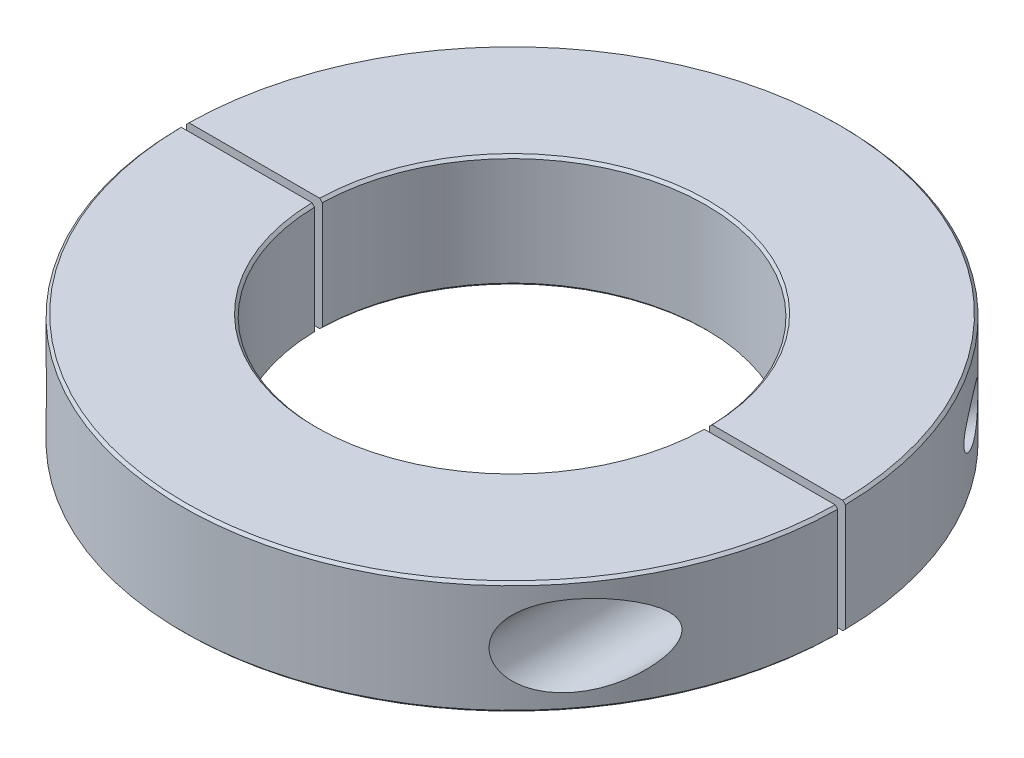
ISO-10303-21;
HEADER;
FILE_DESCRIPTION(('STEP AP214'),'2;1');
FILE_NAME('part.step','',(''),(''),'','','');
FILE_SCHEMA(('AUTOMOTIVE_DESIGN { 1 0 10303 214 1 1 1 1 }'));
ENDSEC;
DATA;
#1=APPLICATION_CONTEXT('core data for automotive mechanical design processes');
#2=APPLICATION_PROTOCOL_DEFINITION('international standard','automotive_design',2000,#1);
#3=PRODUCT_CONTEXT('',#1,'mechanical');
#4=PRODUCT('Part','Part','',(#3));
#5=PRODUCT_RELATED_PRODUCT_CATEGORY('part','',(#4));
#6=PRODUCT_DEFINITION_FORMATION('','',#4);
#7=PRODUCT_DEFINITION_CONTEXT('part definition',#1,'design');
#8=PRODUCT_DEFINITION('design','',#6,#7);
#9=PRODUCT_DEFINITION_SHAPE('','',#8);
#10=(LENGTH_UNIT() NAMED_UNIT(*) SI_UNIT(.MILLI.,.METRE.));
#11=(NAMED_UNIT(*) PLANE_ANGLE_UNIT() SI_UNIT($,.RADIAN.));
#12=(NAMED_UNIT(*) SI_UNIT($,.STERADIAN.) SOLID_ANGLE_UNIT());
#13=UNCERTAINTY_MEASURE_WITH_UNIT(LENGTH_MEASURE(1.E-05),#10,'distance_accuracy_value','');
#14=(GEOMETRIC_REPRESENTATION_CONTEXT(3) GLOBAL_UNCERTAINTY_ASSIGNED_CONTEXT((#13)) GLOBAL_UNIT_ASSIGNED_CONTEXT((#10,
#11,#12)) REPRESENTATION_CONTEXT('',''));
#15=CARTESIAN_POINT('',(0.,0.,0.));
#16=DIRECTION('',(0.,0.,1.));
#17=DIRECTION('',(1.,0.,0.));
#18=AXIS2_PLACEMENT_3D('',#15,#16,#17);
#19=CARTESIAN_POINT('',(0.,0.,-0.762));
#20=DIRECTION('',(0.,0.,1.));
#21=DIRECTION('',(1.,0.,0.));
#22=AXIS2_PLACEMENT_3D('',#19,#20,#21);
#23=PLANE('',#22);
#24=CARTESIAN_POINT('',(-51.4564234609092,-200.42124000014,-0.762));
#25=DIRECTION('',(0.,0.,1.));
#26=DIRECTION('',(1.,0.,0.));
#27=AXIS2_PLACEMENT_3D('',#24,#25,#26);
#28=CIRCLE('',#27,4.21640000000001);
#29=CARTESIAN_POINT('',(-47.2400234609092,-200.42124000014,-0.762));
#30=VERTEX_POINT('',#29);
#31=EDGE_CURVE('E289',#30,#30,#28,.T.);
#32=ORIENTED_EDGE('',*,*,#31,.F.);
#33=EDGE_LOOP('',(#32));
#34=FACE_BOUND('',#33,.T.);
#35=DIRECTION('',(0.,-1.,0.));
#36=VECTOR('',#35,1.);
#37=CARTESIAN_POINT('',(-64.8204676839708,-373.211240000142,-0.762));
#38=LINE('',#37,#36);
#39=CARTESIAN_POINT('',(-64.8204676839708,-211.02574000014,-0.762));
#40=VERTEX_POINT('',#39);
#41=CARTESIAN_POINT('',(-64.8204676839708,-189.816740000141,-0.762));
#42=VERTEX_POINT('',#41);
#43=EDGE_CURVE('E127',#40,#42,#38,.F.);
#44=ORIENTED_EDGE('',*,*,#43,.F.);
#45=CARTESIAN_POINT('',(-64.8204676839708,-211.02574000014,-0.762));
#46=CARTESIAN_POINT('',(-64.7357951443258,-211.110406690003,-0.762));
#47=CARTESIAN_POINT('',(-64.6511225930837,-211.195073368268,-0.762));
#48=CARTESIAN_POINT('',(-64.4817774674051,-211.364406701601,-0.762));
#49=CARTESIAN_POINT('',(-64.3971048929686,-211.44907335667,-0.762));
#50=CARTESIAN_POINT('',(-64.312432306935,-211.53374000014,-0.762));
#51=B_SPLINE_CURVE_WITH_KNOTS('',3,(#45,#46,#47,#48,#49,#50),.UNSPECIFIED.,.F.,.F.,(4,2,4),(0.,
0.359222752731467,0.718445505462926),.UNSPECIFIED.);
#52=CARTESIAN_POINT('',(-64.312432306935,-211.53374000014,-0.762));
#53=VERTEX_POINT('',#52);
#54=EDGE_CURVE('E122',#40,#53,#51,.T.);
#55=ORIENTED_EDGE('',*,*,#54,.T.);
#56=DIRECTION('',(1.,0.,0.));
#57=VECTOR('',#56,1.);
#58=CARTESIAN_POINT('',(0.,-211.53374000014,-0.762));
#59=LINE('',#58,#57);
#60=CARTESIAN_POINT('',(-38.6004795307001,-211.53374000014,-0.762));
#61=VERTEX_POINT('',#60);
#62=EDGE_CURVE('E124',#53,#61,#59,.T.);
#63=ORIENTED_EDGE('',*,*,#62,.T.);
#64=CARTESIAN_POINT('',(-38.6004795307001,-211.53374000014,-0.762));
#65=CARTESIAN_POINT('',(-38.5157962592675,-211.449073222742,-0.762));
#66=CARTESIAN_POINT('',(-38.4311129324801,-211.36440650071,-0.762));
#67=CARTESIAN_POINT('',(-38.2617461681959,-211.195073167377,-0.762));
#68=CARTESIAN_POINT('',(-38.1770627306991,-211.110406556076,-0.762));
#69=CARTESIAN_POINT('',(-38.0923792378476,-211.02574000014,-0.762));
#70=B_SPLINE_CURVE_WITH_KNOTS('',3,(#64,#65,#66,#67,#68,#69),.UNSPECIFIED.,.F.,.F.,(4,2,4),(0.,
0.359245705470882,0.718491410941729),.UNSPECIFIED.);
#71=CARTESIAN_POINT('',(-38.0923792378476,-211.02574000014,-0.762));
#72=VERTEX_POINT('',#71);
#73=EDGE_CURVE('E132',#61,#72,#70,.T.);
#74=ORIENTED_EDGE('',*,*,#73,.T.);
#75=DIRECTION('',(0.,-1.,0.));
#76=VECTOR('',#75,1.);
#77=CARTESIAN_POINT('',(-38.0923792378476,-373.211240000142,-0.762));
#78=LINE('',#77,#76);
#79=CARTESIAN_POINT('',(-38.0923792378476,-189.816740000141,-0.762));
#80=VERTEX_POINT('',#79);
#81=EDGE_CURVE('E277',#72,#80,#78,.F.);
#82=ORIENTED_EDGE('',*,*,#81,.T.);
#83=CARTESIAN_POINT('',(-38.0923792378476,-189.816740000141,-0.762));
#84=CARTESIAN_POINT('',(-38.1770627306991,-189.732073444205,-0.762));
#85=CARTESIAN_POINT('',(-38.2617461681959,-189.647406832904,-0.762));
#86=CARTESIAN_POINT('',(-38.4311129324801,-189.478073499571,-0.762));
#87=CARTESIAN_POINT('',(-38.5157962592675,-189.393406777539,-0.762));
#88=CARTESIAN_POINT('',(-38.6004795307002,-189.308740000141,-0.762));
#89=B_SPLINE_CURVE_WITH_KNOTS('',3,(#83,#84,#85,#86,#87,#88),.UNSPECIFIED.,.F.,.F.,(4,2,4),(0.,
0.359245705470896,0.718491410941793),.UNSPECIFIED.);
#90=CARTESIAN_POINT('',(-38.6004795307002,-189.308740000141,-0.762));
#91=VERTEX_POINT('',#90);
#92=EDGE_CURVE('E72',#80,#91,#89,.T.);
#93=ORIENTED_EDGE('',*,*,#92,.T.);
#94=DIRECTION('',(1.,0.,0.));
#95=VECTOR('',#94,1.);
#96=CARTESIAN_POINT('',(1.96609301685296E-13,-189.308740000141,-0.762));
#97=LINE('',#96,#95);
#98=CARTESIAN_POINT('',(-64.312432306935,-189.308740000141,-0.762));
#99=VERTEX_POINT('',#98);
#100=EDGE_CURVE('E271',#99,#91,#97,.T.);
#101=ORIENTED_EDGE('',*,*,#100,.F.);
#102=CARTESIAN_POINT('',(-64.312432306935,-189.308740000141,-0.762));
#103=CARTESIAN_POINT('',(-64.3971048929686,-189.393406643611,-0.762));
#104=CARTESIAN_POINT('',(-64.4817774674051,-189.47807329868,-0.762));
#105=CARTESIAN_POINT('',(-64.6511225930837,-189.647406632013,-0.762));
#106=CARTESIAN_POINT('',(-64.7357951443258,-189.732073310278,-0.762));
#107=CARTESIAN_POINT('',(-64.8204676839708,-189.816740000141,-0.762));
#108=B_SPLINE_CURVE_WITH_KNOTS('',3,(#102,#103,#104,#105,#106,#107),.UNSPECIFIED.,.F.,.F.,(4,2,
4),(0.,0.359222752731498,0.718445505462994),.UNSPECIFIED.);
#109=EDGE_CURVE('E203',#99,#42,#108,.T.);
#110=ORIENTED_EDGE('',*,*,#109,.T.);
#111=EDGE_LOOP('',(#44,#55,#63,#74,#82,#93,#101,#110));
#112=FACE_BOUND('',#111,.T.);
#113=ADVANCED_FACE('F56',(#34,#112),#23,.T.);
#114=CARTESIAN_POINT('',(51.4624731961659,-200.42124000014,-0.762));
#115=DIRECTION('',(0.,0.,1.));
#116=DIRECTION('',(1.,0.,0.));
#117=AXIS2_PLACEMENT_3D('',#114,#115,#116);
#118=CIRCLE('',#117,4.21640000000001);
#119=CARTESIAN_POINT('',(55.6788731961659,-200.42124000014,-0.762));
#120=VERTEX_POINT('',#119);
#121=EDGE_CURVE('E294',#120,#120,#118,.T.);
#122=ORIENTED_EDGE('',*,*,#121,.F.);
#123=EDGE_LOOP('',(#122));
#124=FACE_BOUND('',#123,.T.);
#125=CARTESIAN_POINT('',(38.6004795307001,-211.53374000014,-0.762));
#126=VERTEX_POINT('',#125);
#127=CARTESIAN_POINT('',(64.312432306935,-211.53374000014,-0.762));
#128=VERTEX_POINT('',#127);
#129=EDGE_CURVE('E143',#126,#128,#59,.T.);
#130=ORIENTED_EDGE('',*,*,#129,.T.);
#131=CARTESIAN_POINT('',(64.312432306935,-211.53374000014,-0.762));
#132=CARTESIAN_POINT('',(64.3971048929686,-211.44907335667,-0.762));
#133=CARTESIAN_POINT('',(64.4817774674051,-211.364406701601,-0.762));
#134=CARTESIAN_POINT('',(64.6511225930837,-211.195073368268,-0.762));
#135=CARTESIAN_POINT('',(64.7357951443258,-211.110406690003,-0.762));
#136=CARTESIAN_POINT('',(64.8204676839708,-211.02574000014,-0.762));
#137=B_SPLINE_CURVE_WITH_KNOTS('',3,(#131,#132,#133,#134,#135,#136),.UNSPECIFIED.,.F.,.F.,(4,2,
4),(0.,0.359222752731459,0.718445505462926),.UNSPECIFIED.);
#138=CARTESIAN_POINT('',(64.8204676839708,-211.02574000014,-0.762));
#139=VERTEX_POINT('',#138);
#140=EDGE_CURVE('E146',#128,#139,#137,.T.);
#141=ORIENTED_EDGE('',*,*,#140,.T.);
#142=DIRECTION('',(0.,-1.,0.));
#143=VECTOR('',#142,1.);
#144=CARTESIAN_POINT('',(64.8204676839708,-373.211240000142,-0.762));
#145=LINE('',#144,#143);
#146=CARTESIAN_POINT('',(64.8204676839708,-189.816740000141,-0.762));
#147=VERTEX_POINT('',#146);
#148=EDGE_CURVE('E266',#147,#139,#145,.T.);
#149=ORIENTED_EDGE('',*,*,#148,.F.);
#150=CARTESIAN_POINT('',(64.8204676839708,-189.816740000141,-0.762));
#151=CARTESIAN_POINT('',(64.7357951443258,-189.732073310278,-0.762));
#152=CARTESIAN_POINT('',(64.6511225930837,-189.647406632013,-0.762));
#153=CARTESIAN_POINT('',(64.4817774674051,-189.47807329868,-0.762));
#154=CARTESIAN_POINT('',(64.3971048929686,-189.393406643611,-0.762));
#155=CARTESIAN_POINT('',(64.312432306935,-189.308740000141,-0.762));
#156=B_SPLINE_CURVE_WITH_KNOTS('',3,(#150,#151,#152,#153,#154,#155),.UNSPECIFIED.,.F.,.F.,(4,2,
4),(0.,0.359222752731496,0.718445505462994),.UNSPECIFIED.);
#157=CARTESIAN_POINT('',(64.312432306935,-189.308740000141,-0.762));
#158=VERTEX_POINT('',#157);
#159=EDGE_CURVE('E149',#147,#158,#156,.T.);
#160=ORIENTED_EDGE('',*,*,#159,.T.);
#161=CARTESIAN_POINT('',(38.6004795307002,-189.308740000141,-0.762));
#162=VERTEX_POINT('',#161);
#163=EDGE_CURVE('E151',#162,#158,#97,.T.);
#164=ORIENTED_EDGE('',*,*,#163,.F.);
#165=CARTESIAN_POINT('',(38.6004795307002,-189.308740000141,-0.762));
#166=CARTESIAN_POINT('',(38.5157962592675,-189.393406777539,-0.762));
#167=CARTESIAN_POINT('',(38.4311129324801,-189.478073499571,-0.762));
#168=CARTESIAN_POINT('',(38.2617461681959,-189.647406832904,-0.762));
#169=CARTESIAN_POINT('',(38.1770627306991,-189.732073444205,-0.762));
#170=CARTESIAN_POINT('',(38.0923792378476,-189.816740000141,-0.762));
#171=B_SPLINE_CURVE_WITH_KNOTS('',3,(#165,#166,#167,#168,#169,#170),.UNSPECIFIED.,.F.,.F.,(4,2,
4),(0.,0.359245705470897,0.718491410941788),.UNSPECIFIED.);
#172=CARTESIAN_POINT('',(38.0923792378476,-189.816740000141,-0.762));
#173=VERTEX_POINT('',#172);
#174=EDGE_CURVE('E147',#162,#173,#171,.T.);
#175=ORIENTED_EDGE('',*,*,#174,.T.);
#176=DIRECTION('',(0.,-1.,0.));
#177=VECTOR('',#176,1.);
#178=CARTESIAN_POINT('',(38.0923792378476,-373.211240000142,-0.762));
#179=LINE('',#178,#177);
#180=CARTESIAN_POINT('',(38.0923792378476,-211.02574000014,-0.762));
#181=VERTEX_POINT('',#180);
#182=EDGE_CURVE('E142',#173,#181,#179,.T.);
#183=ORIENTED_EDGE('',*,*,#182,.T.);
#184=CARTESIAN_POINT('',(38.0923792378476,-211.02574000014,-0.762));
#185=CARTESIAN_POINT('',(38.1770627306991,-211.110406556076,-0.762));
#186=CARTESIAN_POINT('',(38.2617461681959,-211.195073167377,-0.762));
#187=CARTESIAN_POINT('',(38.4311129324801,-211.36440650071,-0.762));
#188=CARTESIAN_POINT('',(38.5157962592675,-211.449073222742,-0.762));
#189=CARTESIAN_POINT('',(38.6004795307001,-211.53374000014,-0.762));
#190=B_SPLINE_CURVE_WITH_KNOTS('',3,(#184,#185,#186,#187,#188,#189),.UNSPECIFIED.,.F.,.F.,(4,2,
4),(0.,0.359245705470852,0.718491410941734),.UNSPECIFIED.);
#191=EDGE_CURVE('E181',#181,#126,#190,.T.);
#192=ORIENTED_EDGE('',*,*,#191,.T.);
#193=EDGE_LOOP('',(#130,#141,#149,#160,#164,#175,#183,#192));
#194=FACE_BOUND('',#193,.T.);
#195=ADVANCED_FACE('F169',(#124,#194),#23,.T.);
#196=CARTESIAN_POINT('',(1.96609301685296E-13,-189.308740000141,0.));
#197=DIRECTION('',(0.,1.,0.));
#198=DIRECTION('',(-1.,0.,0.));
#199=AXIS2_PLACEMENT_3D('',#196,#197,#198);
#200=PLANE('',#199);
#201=ORIENTED_EDGE('',*,*,#163,.T.);
#202=CARTESIAN_POINT('',(0.,-189.308740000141,0.));
#203=DIRECTION('',(0.,1.,0.));
#204=DIRECTION('',(-1.,0.,0.));
#205=AXIS2_PLACEMENT_3D('',#202,#203,#204);
#206=CIRCLE('',#205,64.3169463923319);
#207=EDGE_CURVE('E13',#158,#99,#206,.T.);
#208=ORIENTED_EDGE('',*,*,#207,.T.);
#209=ORIENTED_EDGE('',*,*,#100,.T.);
#210=CARTESIAN_POINT('',(0.,-189.308740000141,0.));
#211=DIRECTION('',(0.,1.,0.));
#212=DIRECTION('',(-1.,0.,0.));
#213=AXIS2_PLACEMENT_3D('',#210,#211,#212);
#214=CIRCLE('',#213,38.608);
#215=EDGE_CURVE('E65',#91,#162,#214,.F.);
#216=ORIENTED_EDGE('',*,*,#215,.T.);
#217=EDGE_LOOP('',(#201,#208,#209,#216));
#218=FACE_BOUND('',#217,.T.);
#219=ADVANCED_FACE('F235',(#218),#200,.T.);
#220=CARTESIAN_POINT('',(0.,-373.211240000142,0.));
#221=DIRECTION('',(0.,-1.,0.));
#222=DIRECTION('',(1.,0.,0.));
#223=AXIS2_PLACEMENT_3D('',#220,#221,#222);
#224=CYLINDRICAL_SURFACE('',#223,38.1);
#225=ORIENTED_EDGE('',*,*,#81,.F.);
#226=CARTESIAN_POINT('',(0.,-211.02574000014,0.));
#227=DIRECTION('',(0.,1.,0.));
#228=DIRECTION('',(-1.,0.,0.));
#229=AXIS2_PLACEMENT_3D('',#226,#227,#228);
#230=CIRCLE('',#229,38.1);
#231=EDGE_CURVE('E281',#72,#181,#230,.F.);
#232=ORIENTED_EDGE('',*,*,#231,.T.);
#233=ORIENTED_EDGE('',*,*,#182,.F.);
#234=CARTESIAN_POINT('',(0.,-189.816740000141,0.));
#235=DIRECTION('',(0.,1.,0.));
#236=DIRECTION('',(-1.,0.,0.));
#237=AXIS2_PLACEMENT_3D('',#234,#235,#236);
#238=CIRCLE('',#237,38.1);
#239=EDGE_CURVE('E131',#173,#80,#238,.T.);
#240=ORIENTED_EDGE('',*,*,#239,.T.);
#241=EDGE_LOOP('',(#225,#232,#233,#240));
#242=FACE_BOUND('',#241,.T.);
#243=ADVANCED_FACE('F237',(#242),#224,.F.);
#244=CARTESIAN_POINT('',(0.,-373.211240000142,0.));
#245=DIRECTION('',(0.,-1.,0.));
#246=DIRECTION('',(1.,0.,0.));
#247=AXIS2_PLACEMENT_3D('',#244,#245,#246);
#248=CYLINDRICAL_SURFACE('',#247,64.8249463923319);
#249=CARTESIAN_POINT('',(-47.2400234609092,-200.42124000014,-44.3920472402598));
#250=CARTESIAN_POINT('',(-47.240018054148,-200.32965179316,-44.3920525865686));
#251=CARTESIAN_POINT('',(-47.2430108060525,-200.238102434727,-44.3888687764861));
#252=CARTESIAN_POINT('',(-47.2548985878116,-200.055795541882,-44.3762134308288));
#253=CARTESIAN_POINT('',(-47.2637945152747,-199.965038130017,-44.3667409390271));
#254=CARTESIAN_POINT('',(-47.2873018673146,-199.785084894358,-44.3416852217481));
#255=CARTESIAN_POINT('',(-47.301915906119,-199.695889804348,-44.3260992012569));
#256=CARTESIAN_POINT('',(-47.3365396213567,-199.51976417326,-44.2891220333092));
#257=CARTESIAN_POINT('',(-47.3565517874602,-199.432834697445,-44.2677282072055));
#258=CARTESIAN_POINT('',(-47.4237943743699,-199.177595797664,-44.1957204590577));
#259=CARTESIAN_POINT('',(-47.4784280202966,-199.013397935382,-44.1370714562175));
#260=CARTESIAN_POINT('',(-47.6038533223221,-198.699488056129,-44.0017648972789));
#261=CARTESIAN_POINT('',(-47.6746521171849,-198.549782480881,-43.92509938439));
#262=CARTESIAN_POINT('',(-47.8608133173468,-198.207260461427,-43.7223287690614));
#263=CARTESIAN_POINT('',(-47.9824958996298,-198.022223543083,-43.588890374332));
#264=CARTESIAN_POINT('',(-48.2427839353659,-197.683276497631,-43.3006384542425));
#265=CARTESIAN_POINT('',(-48.3814251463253,-197.529434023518,-43.1457796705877));
#266=CARTESIAN_POINT('',(-48.6304483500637,-197.288631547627,-42.8646524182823));
#267=CARTESIAN_POINT('',(-48.7383683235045,-197.1948232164,-42.7419361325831));
#268=CARTESIAN_POINT('',(-48.9582204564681,-197.021740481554,-42.4899313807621));
#269=CARTESIAN_POINT('',(-49.0701543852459,-196.94247258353,-42.3606400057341));
#270=CARTESIAN_POINT('',(-49.2967579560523,-196.797430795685,-42.0967176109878));
#271=CARTESIAN_POINT('',(-49.4114308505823,-196.731673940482,-41.9620801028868));
#272=CARTESIAN_POINT('',(-49.6423290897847,-196.61283543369,-41.6886661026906));
#273=CARTESIAN_POINT('',(-49.7585543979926,-196.559753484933,-41.5498897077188));
#274=CARTESIAN_POINT('',(-50.0474494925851,-196.44287551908,-41.2019309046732));
#275=CARTESIAN_POINT('',(-50.2205760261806,-196.386063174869,-40.9907662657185));
#276=CARTESIAN_POINT('',(-50.5665406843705,-196.295939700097,-40.5632146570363));
#277=CARTESIAN_POINT('',(-50.7393786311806,-196.262639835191,-40.3468252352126));
#278=CARTESIAN_POINT('',(-51.0835912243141,-196.217766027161,-39.9101215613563));
#279=CARTESIAN_POINT('',(-51.2549630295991,-196.206227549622,-39.689801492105));
#280=CARTESIAN_POINT('',(-51.5948505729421,-196.203688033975,-39.246948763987));
#281=CARTESIAN_POINT('',(-51.7633667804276,-196.212683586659,-39.0244164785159));
#282=CARTESIAN_POINT('',(-52.1024925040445,-196.251018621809,-38.5705451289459));
#283=CARTESIAN_POINT('',(-52.2729723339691,-196.281052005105,-38.3391680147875));
#284=CARTESIAN_POINT('',(-52.6091886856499,-196.361798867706,-37.8764930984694));
#285=CARTESIAN_POINT('',(-52.7749241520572,-196.412516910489,-37.6451953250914));
#286=CARTESIAN_POINT('',(-53.1004316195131,-196.534669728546,-37.184636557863));
#287=CARTESIAN_POINT('',(-53.2602154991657,-196.606060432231,-36.9553722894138));
#288=CARTESIAN_POINT('',(-53.5731948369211,-196.770410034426,-36.500173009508));
#289=CARTESIAN_POINT('',(-53.7263936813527,-196.863357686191,-36.2742363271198));
#290=CARTESIAN_POINT('',(-53.95723526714,-197.025085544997,-35.9292640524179));
#291=CARTESIAN_POINT('',(-54.0376366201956,-197.085710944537,-35.8082137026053));
#292=CARTESIAN_POINT('',(-54.1958166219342,-197.214348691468,-35.5683531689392));
#293=CARTESIAN_POINT('',(-54.2735957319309,-197.282359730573,-35.4495425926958));
#294=CARTESIAN_POINT('',(-54.4262049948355,-197.426338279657,-35.2147908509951));
#295=CARTESIAN_POINT('',(-54.5010340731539,-197.502308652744,-35.0988507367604));
#296=CARTESIAN_POINT('',(-54.6472229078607,-197.662867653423,-34.870804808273));
#297=CARTESIAN_POINT('',(-54.7185833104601,-197.747454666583,-34.7586982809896));
#298=CARTESIAN_POINT('',(-54.842394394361,-197.907053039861,-34.562926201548));
#299=CARTESIAN_POINT('',(-54.8956334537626,-197.980262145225,-34.4782919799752));
#300=CARTESIAN_POINT('',(-54.9990990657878,-198.133011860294,-34.3130044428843));
#301=CARTESIAN_POINT('',(-55.0493264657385,-198.212550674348,-34.2323500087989));
#302=CARTESIAN_POINT('',(-55.1461202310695,-198.378358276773,-34.0762016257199));
#303=CARTESIAN_POINT('',(-55.1926927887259,-198.464615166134,-34.0006989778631));
#304=CARTESIAN_POINT('',(-55.2814721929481,-198.644423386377,-33.85616191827));
#305=CARTESIAN_POINT('',(-55.3236817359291,-198.737970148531,-33.7871235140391));
#306=CARTESIAN_POINT('',(-55.4114508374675,-198.954193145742,-33.643028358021));
#307=CARTESIAN_POINT('',(-55.4557183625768,-199.07876114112,-33.5699667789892));
#308=CARTESIAN_POINT('',(-55.5339037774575,-199.339297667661,-33.4404687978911));
#309=CARTESIAN_POINT('',(-55.5678365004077,-199.475249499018,-33.3840085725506));
#310=CARTESIAN_POINT('',(-55.6184106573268,-199.735221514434,-33.2996715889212));
#311=CARTESIAN_POINT('',(-55.6369065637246,-199.857870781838,-33.2687379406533));
#312=CARTESIAN_POINT('',(-55.6630012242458,-200.107496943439,-33.2250604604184));
#313=CARTESIAN_POINT('',(-55.6706091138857,-200.23447011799,-33.2123013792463));
#314=CARTESIAN_POINT('',(-55.6742027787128,-200.489339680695,-33.2062770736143));
#315=CARTESIAN_POINT('',(-55.6701630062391,-200.617237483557,-33.2130547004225));
#316=CARTESIAN_POINT('',(-55.6508186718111,-200.869746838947,-33.2454566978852));
#317=CARTESIAN_POINT('',(-55.6355057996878,-200.994355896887,-33.2710949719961));
#318=CARTESIAN_POINT('',(-55.59042006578,-201.264311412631,-33.3463815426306));
#319=CARTESIAN_POINT('',(-55.5581860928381,-201.408094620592,-33.4001058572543));
#320=CARTESIAN_POINT('',(-55.4819645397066,-201.68361872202,-33.5265677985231));
#321=CARTESIAN_POINT('',(-55.437954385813,-201.815335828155,-33.5993419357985));
#322=CARTESIAN_POINT('',(-55.314851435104,-202.133985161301,-33.8017933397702));
#323=CARTESIAN_POINT('',(-55.2296287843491,-202.312455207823,-33.9410097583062));
#324=CARTESIAN_POINT('',(-55.0912798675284,-202.560118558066,-34.1647837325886));
#325=CARTESIAN_POINT('',(-55.043326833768,-202.639442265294,-34.2420006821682));
#326=CARTESIAN_POINT('',(-54.9444131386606,-202.791937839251,-34.4004916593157));
#327=CARTESIAN_POINT('',(-54.8934531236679,-202.865111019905,-34.4817648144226));
#328=CARTESIAN_POINT('',(-54.7487719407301,-203.059904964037,-34.7113188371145));
#329=CARTESIAN_POINT('',(-54.65232872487,-203.175464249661,-34.8630253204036));
#330=CARTESIAN_POINT('',(-54.4531560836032,-203.390943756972,-35.1733072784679));
#331=CARTESIAN_POINT('',(-54.3504220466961,-203.490852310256,-35.3318877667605));
#332=CARTESIAN_POINT('',(-54.1396020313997,-203.676753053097,-35.6540923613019));
#333=CARTESIAN_POINT('',(-54.0315058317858,-203.762717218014,-35.8177258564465));
#334=CARTESIAN_POINT('',(-53.8109481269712,-203.921625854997,-36.1482370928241));
#335=CARTESIAN_POINT('',(-53.6984873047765,-203.994572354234,-36.3151143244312));
#336=CARTESIAN_POINT('',(-53.4121581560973,-204.161940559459,-36.7356536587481));
#337=CARTESIAN_POINT('',(-53.2358628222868,-204.248700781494,-36.9907355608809));
#338=CARTESIAN_POINT('',(-52.8759802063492,-204.396249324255,-37.503368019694));
#339=CARTESIAN_POINT('',(-52.6923891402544,-204.4570239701,-37.7609198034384));
#340=CARTESIAN_POINT('',(-52.3191367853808,-204.552931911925,-38.2764007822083));
#341=CARTESIAN_POINT('',(-52.129475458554,-204.588065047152,-38.5343299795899));
#342=CARTESIAN_POINT('',(-51.7452990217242,-204.632171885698,-39.0486960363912));
#343=CARTESIAN_POINT('',(-51.5507859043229,-204.641156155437,-39.3051334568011));
#344=CARTESIAN_POINT('',(-51.2013840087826,-204.632703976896,-39.758709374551));
#345=CARTESIAN_POINT('',(-51.0471859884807,-204.620642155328,-39.9564894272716));
#346=CARTESIAN_POINT('',(-50.7373932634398,-204.578818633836,-40.3491400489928));
#347=CARTESIAN_POINT('',(-50.5817984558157,-204.549055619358,-40.5440104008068));
#348=CARTESIAN_POINT('',(-50.2705651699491,-204.470619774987,-40.929270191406));
#349=CARTESIAN_POINT('',(-50.1149273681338,-204.4219839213,-41.1196676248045));
#350=CARTESIAN_POINT('',(-49.8047095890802,-204.304201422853,-41.4948640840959));
#351=CARTESIAN_POINT('',(-49.6501291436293,-204.23506455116,-41.6796657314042));
#352=CARTESIAN_POINT('',(-49.3988586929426,-204.103186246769,-41.9767740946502));
#353=CARTESIAN_POINT('',(-49.3013053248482,-204.047056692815,-42.0912926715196));
#354=CARTESIAN_POINT('',(-49.1080555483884,-203.924990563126,-42.3166002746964));
#355=CARTESIAN_POINT('',(-49.0123594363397,-203.859052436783,-42.4273887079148));
#356=CARTESIAN_POINT('',(-48.7293733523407,-203.645680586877,-42.7528222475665));
#357=CARTESIAN_POINT('',(-48.5458192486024,-203.482504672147,-42.9609678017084));
#358=CARTESIAN_POINT('',(-48.2425900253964,-203.157180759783,-43.3008586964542));
#359=CARTESIAN_POINT('',(-48.1185466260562,-203.005340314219,-43.4385661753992));
#360=CARTESIAN_POINT('',(-47.8868567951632,-202.674426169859,-43.6938457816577));
#361=CARTESIAN_POINT('',(-47.7791877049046,-202.495390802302,-43.8114457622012));
#362=CARTESIAN_POINT('',(-47.6083757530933,-202.152929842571,-43.996915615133));
#363=CARTESIAN_POINT('',(-47.5406448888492,-201.994656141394,-44.0700366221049));
#364=CARTESIAN_POINT('',(-47.4235020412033,-201.663899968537,-44.1960695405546));
#365=CARTESIAN_POINT('',(-47.3740651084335,-201.491437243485,-44.2490089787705));
#366=CARTESIAN_POINT('',(-47.3043718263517,-201.169766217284,-44.323494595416));
#367=CARTESIAN_POINT('',(-47.2803735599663,-201.0222944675,-44.3490751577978));
#368=CARTESIAN_POINT('',(-47.2482041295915,-200.723593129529,-44.383346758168));
#369=CARTESIAN_POINT('',(-47.2400323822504,-200.572363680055,-44.392038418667));
#370=CARTESIAN_POINT('',(-47.2400234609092,-200.42124000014,-44.3920472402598));
#371=B_SPLINE_CURVE_WITH_KNOTS('',3,(#249,#250,#251,#252,#253,#254,#255,#256,#257,#258,#259,
#260,#261,#262,#263,#264,#265,#266,#267,#268,#269,#270,#271,#272,#273,#274,#275,#276,#277,#278,
#279,#280,#281,#282,#283,#284,#285,#286,#287,#288,#289,#290,#291,#292,#293,#294,#295,#296,#297,
#298,#299,#300,#301,#302,#303,#304,#305,#306,#307,#308,#309,#310,#311,#312,#313,#314,#315,#316,
#317,#318,#319,#320,#321,#322,#323,#324,#325,#326,#327,#328,#329,#330,#331,#332,#333,#334,#335,
#336,#337,#338,#339,#340,#341,#342,#343,#344,#345,#346,#347,#348,#349,#350,#351,#352,#353,#354,
#355,#356,#357,#358,#359,#360,#361,#362,#363,#364,#365,#366,#367,#368,#369,#370),.UNSPECIFIED.,
.T.,.F.,(4,2,2,2,2,2,2,2,2,2,2,2,2,2,2,2,2,2,2,2,2,2,2,2,2,2,2,2,2,2,2,2,2,2,2,2,2,2,2,2,2,2,2,
2,2,2,2,2,2,2,2,2,2,2,2,2,2,2,2,2,4),(0.,0.274594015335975,0.549229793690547,0.823991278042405,
1.09887970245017,1.6443179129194,2.18999746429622,2.96137550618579,3.73440899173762,
4.29897140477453,4.86378579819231,5.42930799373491,5.99481692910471,6.83030862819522,
7.66620036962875,8.50345323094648,9.34056709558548,10.2066777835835,11.0729796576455,
11.9374481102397,12.8014665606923,13.2736681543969,13.7457862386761,14.2180747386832,
14.6902749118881,15.0618208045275,15.4332616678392,15.8040589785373,16.1746257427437,
16.6263778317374,17.0774784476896,17.4593488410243,17.8408986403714,18.2232859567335,
18.6059554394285,19.0738613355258,19.5426706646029,20.2639332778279,20.6257111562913,
20.9874115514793,21.6275183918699,22.2681002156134,22.9099539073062,23.5517075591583,
24.5163546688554,25.4815088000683,26.4466689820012,27.41143910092,28.164092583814,
28.9168019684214,29.6680440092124,30.4189284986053,30.9002903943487,31.3817284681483,
32.3428308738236,33.0593302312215,33.7748288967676,34.3338189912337,34.8920438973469,
35.3451501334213,35.7982396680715),.UNSPECIFIED.);
#372=CARTESIAN_POINT('',(-47.2400234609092,-200.42124000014,-44.3920472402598));
#373=VERTEX_POINT('',#372);
#374=EDGE_CURVE('E258',#373,#373,#371,.T.);
#375=ORIENTED_EDGE('',*,*,#374,.T.);
#376=EDGE_LOOP('',(#375));
#377=FACE_BOUND('',#376,.T.);
#378=CARTESIAN_POINT('',(55.6788731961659,-200.42124000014,-33.1984450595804));
#379=CARTESIAN_POINT('',(55.6788645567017,-200.290876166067,-33.1984603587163));
#380=CARTESIAN_POINT('',(55.6727633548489,-200.16041993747,-33.2086988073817));
#381=CARTESIAN_POINT('',(55.6489716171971,-199.903563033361,-33.2485507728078));
#382=CARTESIAN_POINT('',(55.6312643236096,-199.777168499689,-33.2781923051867));
#383=CARTESIAN_POINT('',(55.5803911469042,-199.502156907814,-33.363104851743));
#384=CARTESIAN_POINT('',(55.5445470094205,-199.355421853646,-33.4228001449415));
#385=CARTESIAN_POINT('',(55.4608939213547,-199.075062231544,-33.5614277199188));
#386=CARTESIAN_POINT('',(55.413061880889,-198.9414636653,-33.6403971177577));
#387=CARTESIAN_POINT('',(55.3198054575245,-198.715206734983,-33.7934760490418));
#388=CARTESIAN_POINT('',(55.2761185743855,-198.619962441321,-33.8649094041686));
#389=CARTESIAN_POINT('',(55.1842529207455,-198.437087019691,-34.0144028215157));
#390=CARTESIAN_POINT('',(55.136071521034,-198.349460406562,-34.0924667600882));
#391=CARTESIAN_POINT('',(55.035967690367,-198.181203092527,-34.2538314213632));
#392=CARTESIAN_POINT('',(54.9840393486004,-198.100583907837,-34.3371403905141));
#393=CARTESIAN_POINT('',(54.8770941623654,-197.945916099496,-34.5078016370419));
#394=CARTESIAN_POINT('',(54.8220761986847,-197.871869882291,-34.5951553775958));
#395=CARTESIAN_POINT('',(54.6657469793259,-197.67478719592,-34.8419949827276));
#396=CARTESIAN_POINT('',(54.5616078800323,-197.558264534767,-35.0049094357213));
#397=CARTESIAN_POINT('',(54.3468155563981,-197.341983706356,-35.3374675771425));
#398=CARTESIAN_POINT('',(54.2361575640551,-197.242238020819,-35.507116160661));
#399=CARTESIAN_POINT('',(54.0092575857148,-197.057709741,-35.8513086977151));
#400=CARTESIAN_POINT('',(53.8930047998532,-196.972957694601,-36.0258618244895));
#401=CARTESIAN_POINT('',(53.6559395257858,-196.817518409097,-36.3780004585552));
#402=CARTESIAN_POINT('',(53.5351277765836,-196.746828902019,-36.5555854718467));
#403=CARTESIAN_POINT('',(53.2357506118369,-196.590678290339,-36.9908838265));
#404=CARTESIAN_POINT('',(53.0550357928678,-196.512278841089,-37.2496723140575));
#405=CARTESIAN_POINT('',(52.6866014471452,-196.381719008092,-37.7689977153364));
#406=CARTESIAN_POINT('',(52.4988785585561,-196.329571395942,-38.0295354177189));
#407=CARTESIAN_POINT('',(52.1177445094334,-196.251531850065,-38.5502065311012));
#408=CARTESIAN_POINT('',(51.924335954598,-196.225628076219,-38.8103400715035));
#409=CARTESIAN_POINT('',(51.5330455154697,-196.20087730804,-39.3284141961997));
#410=CARTESIAN_POINT('',(51.3351656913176,-196.202018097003,-39.5863557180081));
#411=CARTESIAN_POINT('',(50.9897134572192,-196.228868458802,-40.0297310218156));
#412=CARTESIAN_POINT('',(50.8428298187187,-196.247930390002,-40.2161192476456));
#413=CARTESIAN_POINT('',(50.5481814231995,-196.302435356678,-40.5858456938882));
#414=CARTESIAN_POINT('',(50.400416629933,-196.337879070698,-40.7691837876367));
#415=CARTESIAN_POINT('',(50.1052610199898,-196.426280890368,-41.1313867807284));
#416=CARTESIAN_POINT('',(49.9578699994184,-196.479208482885,-41.3102588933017));
#417=CARTESIAN_POINT('',(49.6645376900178,-196.604060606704,-41.6624509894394));
#418=CARTESIAN_POINT('',(49.5185958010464,-196.675976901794,-41.8357733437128));
#419=CARTESIAN_POINT('',(49.2791580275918,-196.812482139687,-42.1172152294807));
#420=CARTESIAN_POINT('',(49.1847523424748,-196.871203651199,-42.2274103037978));
#421=CARTESIAN_POINT('',(48.9980015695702,-196.998204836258,-42.4439634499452));
#422=CARTESIAN_POINT('',(48.9056568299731,-197.066486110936,-42.5503208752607));
#423=CARTESIAN_POINT('',(48.6330560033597,-197.286448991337,-42.8622812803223));
#424=CARTESIAN_POINT('',(48.4568607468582,-197.453454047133,-43.0612092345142));
#425=CARTESIAN_POINT('',(48.1679621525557,-197.783241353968,-43.3838150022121));
#426=CARTESIAN_POINT('',(48.0506262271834,-197.935936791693,-43.5136458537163));
#427=CARTESIAN_POINT('',(47.8325791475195,-198.266931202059,-43.7532185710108));
#428=CARTESIAN_POINT('',(47.7318439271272,-198.44519239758,-43.862989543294));
#429=CARTESIAN_POINT('',(47.5722025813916,-198.786755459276,-44.0360098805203));
#430=CARTESIAN_POINT('',(47.5089541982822,-198.945477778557,-44.1041862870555));
#431=CARTESIAN_POINT('',(47.4278975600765,-199.193309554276,-44.1912861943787));
#432=CARTESIAN_POINT('',(47.4031767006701,-199.277568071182,-44.2177969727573));
#433=CARTESIAN_POINT('',(47.3587695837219,-199.448890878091,-44.2653552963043));
#434=CARTESIAN_POINT('',(47.3390811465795,-199.535953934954,-44.2864052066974));
#435=CARTESIAN_POINT('',(47.3050011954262,-199.712974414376,-44.3228063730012));
#436=CARTESIAN_POINT('',(47.2906494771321,-199.802948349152,-44.3381148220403));
#437=CARTESIAN_POINT('',(47.2677639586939,-199.984428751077,-44.3625117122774));
#438=CARTESIAN_POINT('',(47.2592274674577,-200.075934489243,-44.3716030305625));
#439=CARTESIAN_POINT('',(47.24816339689,-200.259717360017,-44.383384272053));
#440=CARTESIAN_POINT('',(47.2456351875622,-200.351994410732,-44.386074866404));
#441=CARTESIAN_POINT('',(47.2466364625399,-200.536447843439,-44.3850088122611));
#442=CARTESIAN_POINT('',(47.2501654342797,-200.62862423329,-44.3812527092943));
#443=CARTESIAN_POINT('',(47.2683409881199,-200.883912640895,-44.3618977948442));
#444=CARTESIAN_POINT('',(47.2895239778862,-201.046121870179,-44.3393344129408));
#445=CARTESIAN_POINT('',(47.3494703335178,-201.363238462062,-44.2753114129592));
#446=CARTESIAN_POINT('',(47.3882358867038,-201.518144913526,-44.23384944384));
#447=CARTESIAN_POINT('',(47.4827670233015,-201.823564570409,-44.1323630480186));
#448=CARTESIAN_POINT('',(47.5391421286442,-201.973664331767,-44.0716717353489));
#449=CARTESIAN_POINT('',(47.665252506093,-202.26074674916,-43.9352481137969));
#450=CARTESIAN_POINT('',(47.7349947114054,-202.397722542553,-43.8595079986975));
#451=CARTESIAN_POINT('',(47.9266261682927,-202.729981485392,-43.6502207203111));
#452=CARTESIAN_POINT('',(48.0559809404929,-202.915456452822,-43.5079139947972));
#453=CARTESIAN_POINT('',(48.3313581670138,-203.25354284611,-43.2018061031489));
#454=CARTESIAN_POINT('',(48.4774223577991,-203.406069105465,-43.0379509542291));
#455=CARTESIAN_POINT('',(48.7394413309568,-203.643897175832,-42.740716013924));
#456=CARTESIAN_POINT('',(48.8530678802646,-203.73628783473,-42.6108263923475));
#457=CARTESIAN_POINT('',(49.0840988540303,-203.905763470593,-42.3444916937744));
#458=CARTESIAN_POINT('',(49.2015049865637,-203.982841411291,-42.2080436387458));
#459=CARTESIAN_POINT('',(49.4387705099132,-204.122813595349,-41.9298832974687));
#460=CARTESIAN_POINT('',(49.5586323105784,-204.185693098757,-41.7881657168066));
#461=CARTESIAN_POINT('',(49.7996320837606,-204.298180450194,-41.50066904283));
#462=CARTESIAN_POINT('',(49.9207700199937,-204.347788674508,-41.3548900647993));
#463=CARTESIAN_POINT('',(50.2201403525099,-204.454897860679,-40.9913340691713));
#464=CARTESIAN_POINT('',(50.398656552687,-204.505292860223,-40.7716814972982));
#465=CARTESIAN_POINT('',(50.7548140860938,-204.581821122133,-40.3274558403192));
#466=CARTESIAN_POINT('',(50.9324549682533,-204.607942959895,-40.1028804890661));
#467=CARTESIAN_POINT('',(51.2858095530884,-204.637674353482,-39.649994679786));
#468=CARTESIAN_POINT('',(51.4615182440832,-204.641234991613,-39.4216771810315));
#469=CARTESIAN_POINT('',(51.809507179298,-204.62694053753,-38.963206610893));
#470=CARTESIAN_POINT('',(51.981788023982,-204.609089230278,-38.7330538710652));
#471=CARTESIAN_POINT('',(52.3274746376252,-204.551792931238,-38.2648195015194));
#472=CARTESIAN_POINT('',(52.500742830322,-204.511681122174,-38.0267178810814));
#473=CARTESIAN_POINT('',(52.8418871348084,-204.409593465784,-37.5512220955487));
#474=CARTESIAN_POINT('',(53.0097616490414,-204.3476112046,-37.3138281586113));
#475=CARTESIAN_POINT('',(53.3385185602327,-204.201547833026,-36.8423448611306));
#476=CARTESIAN_POINT('',(53.4994244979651,-204.117549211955,-36.6082465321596));
#477=CARTESIAN_POINT('',(53.8136276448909,-203.926086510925,-36.1447846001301));
#478=CARTESIAN_POINT('',(53.9669303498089,-203.818639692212,-35.91541764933));
#479=CARTESIAN_POINT('',(54.2525369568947,-203.587405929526,-35.482355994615));
#480=CARTESIAN_POINT('',(54.3855396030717,-203.465614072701,-35.2780755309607));
#481=CARTESIAN_POINT('',(54.5778080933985,-203.264009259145,-34.9792894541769));
#482=CARTESIAN_POINT('',(54.640777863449,-203.193538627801,-34.8808290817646));
#483=CARTESIAN_POINT('',(54.7638398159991,-203.045790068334,-34.6872981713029));
#484=CARTESIAN_POINT('',(54.8239327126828,-202.96851384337,-34.5922267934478));
#485=CARTESIAN_POINT('',(54.941616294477,-202.805322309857,-34.4050119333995));
#486=CARTESIAN_POINT('',(54.9991573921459,-202.719296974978,-34.3129317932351));
#487=CARTESIAN_POINT('',(55.1100168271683,-202.538948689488,-34.1345988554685));
#488=CARTESIAN_POINT('',(55.1633334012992,-202.444622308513,-34.0483484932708));
#489=CARTESIAN_POINT('',(55.3150815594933,-202.148758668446,-33.8016557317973));
#490=CARTESIAN_POINT('',(55.4061377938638,-201.933247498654,-33.6519515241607));
#491=CARTESIAN_POINT('',(55.5181077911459,-201.581014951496,-33.4666829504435));
#492=CARTESIAN_POINT('',(55.5513677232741,-201.458520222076,-33.4114083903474));
#493=CARTESIAN_POINT('',(55.6074235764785,-201.204924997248,-33.3180290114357));
#494=CARTESIAN_POINT('',(55.6302434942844,-201.073845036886,-33.2798848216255));
#495=CARTESIAN_POINT('',(55.6573703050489,-200.85506329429,-33.2344884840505));
#496=CARTESIAN_POINT('',(55.6653971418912,-200.769074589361,-33.2210377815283));
#497=CARTESIAN_POINT('',(55.6761519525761,-200.595817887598,-33.2030101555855));
#498=CARTESIAN_POINT('',(55.6788789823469,-200.508549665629,-33.1984348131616));
#499=CARTESIAN_POINT('',(55.6788731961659,-200.42124000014,-33.1984450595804));
#500=B_SPLINE_CURVE_WITH_KNOTS('',3,(#378,#379,#380,#381,#382,#383,#384,#385,#386,#387,#388,
#389,#390,#391,#392,#393,#394,#395,#396,#397,#398,#399,#400,#401,#402,#403,#404,#405,#406,#407,
#408,#409,#410,#411,#412,#413,#414,#415,#416,#417,#418,#419,#420,#421,#422,#423,#424,#425,#426,
#427,#428,#429,#430,#431,#432,#433,#434,#435,#436,#437,#438,#439,#440,#441,#442,#443,#444,#445,
#446,#447,#448,#449,#450,#451,#452,#453,#454,#455,#456,#457,#458,#459,#460,#461,#462,#463,#464,
#465,#466,#467,#468,#469,#470,#471,#472,#473,#474,#475,#476,#477,#478,#479,#480,#481,#482,#483,
#484,#485,#486,#487,#488,#489,#490,#491,#492,#493,#494,#495,#496,#497,#498,#499),.UNSPECIFIED.,
.T.,.F.,(4,2,2,2,2,2,2,2,2,2,2,2,2,2,2,2,2,2,2,2,2,2,2,2,2,2,2,2,2,2,2,2,2,2,2,2,2,2,2,2,2,2,2,
2,2,2,2,2,2,2,2,2,2,2,2,2,2,2,2,2,4),(0.,0.39073772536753,0.782040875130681,1.26659238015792,
1.75208444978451,2.13202393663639,2.51218709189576,2.89296365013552,3.2738790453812,
3.95004581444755,4.62671343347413,5.30474419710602,5.98266552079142,6.95708836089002,
7.93198480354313,8.90644121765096,9.8804574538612,10.5941618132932,11.3078957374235,
12.0203905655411,12.7325768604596,13.2018468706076,13.6711955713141,14.6080794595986,
15.3025649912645,15.9960346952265,16.5455113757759,16.8203928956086,17.0951551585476,
17.3719270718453,17.6485708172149,17.9251855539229,18.201776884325,18.6946867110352,
19.1876578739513,19.7000485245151,20.2127056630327,21.0097605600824,21.8088516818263,
22.3953439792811,22.9821051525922,23.5694726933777,24.1568235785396,25.0180523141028,
25.8796861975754,26.743187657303,27.6065364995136,28.4972634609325,29.3882518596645,
30.2759485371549,31.1629939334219,31.9790699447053,32.3882986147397,32.7974251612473,
33.2125485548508,33.6278443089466,34.4527917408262,34.8668161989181,35.2798841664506,
35.5415296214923,35.8032216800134),.UNSPECIFIED.);
#501=CARTESIAN_POINT('',(55.6788731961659,-200.42124000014,-33.1984450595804));
#502=VERTEX_POINT('',#501);
#503=EDGE_CURVE('E262',#502,#502,#500,.T.);
#504=ORIENTED_EDGE('',*,*,#503,.T.);
#505=EDGE_LOOP('',(#504));
#506=FACE_BOUND('',#505,.T.);
#507=ORIENTED_EDGE('',*,*,#148,.T.);
#508=CARTESIAN_POINT('',(0.,-211.02574000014,0.));
#509=DIRECTION('',(0.,1.,0.));
#510=DIRECTION('',(-1.,0.,0.));
#511=AXIS2_PLACEMENT_3D('',#508,#509,#510);
#512=CIRCLE('',#511,64.8249463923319);
#513=EDGE_CURVE('E267',#139,#40,#512,.T.);
#514=ORIENTED_EDGE('',*,*,#513,.T.);
#515=ORIENTED_EDGE('',*,*,#43,.T.);
#516=CARTESIAN_POINT('',(0.,-189.816740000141,0.));
#517=DIRECTION('',(0.,1.,0.));
#518=DIRECTION('',(-1.,0.,0.));
#519=AXIS2_PLACEMENT_3D('',#516,#517,#518);
#520=CIRCLE('',#519,64.8249463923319);
#521=EDGE_CURVE('E269',#42,#147,#520,.F.);
#522=ORIENTED_EDGE('',*,*,#521,.T.);
#523=EDGE_LOOP('',(#507,#514,#515,#522));
#524=FACE_BOUND('',#523,.T.);
#525=ADVANCED_FACE('F174',(#377,#506,#524),#248,.T.);
#526=CARTESIAN_POINT('',(0.,-211.53374000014,0.));
#527=DIRECTION('',(0.,1.,0.));
#528=DIRECTION('',(-1.,0.,0.));
#529=AXIS2_PLACEMENT_3D('',#526,#527,#528);
#530=PLANE('',#529);
#531=ORIENTED_EDGE('',*,*,#62,.F.);
#532=CARTESIAN_POINT('',(0.,-211.53374000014,0.));
#533=DIRECTION('',(0.,1.,0.));
#534=DIRECTION('',(-1.,0.,0.));
#535=AXIS2_PLACEMENT_3D('',#532,#533,#534);
#536=CIRCLE('',#535,64.3169463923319);
#537=EDGE_CURVE('E138',#53,#128,#536,.F.);
#538=ORIENTED_EDGE('',*,*,#537,.T.);
#539=ORIENTED_EDGE('',*,*,#129,.F.);
#540=CARTESIAN_POINT('',(0.,-211.53374000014,0.));
#541=DIRECTION('',(0.,1.,0.));
#542=DIRECTION('',(-1.,0.,0.));
#543=AXIS2_PLACEMENT_3D('',#540,#541,#542);
#544=CIRCLE('',#543,38.608);
#545=EDGE_CURVE('E141',#126,#61,#544,.T.);
#546=ORIENTED_EDGE('',*,*,#545,.T.);
#547=EDGE_LOOP('',(#531,#538,#539,#546));
#548=FACE_BOUND('',#547,.T.);
#549=ADVANCED_FACE('F136',(#548),#530,.F.);
#550=CARTESIAN_POINT('',(51.4624731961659,-200.42124000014,-64.8259463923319));
#551=DIRECTION('',(0.,0.,1.));
#552=DIRECTION('',(1.,0.,0.));
#553=AXIS2_PLACEMENT_3D('',#550,#551,#552);
#554=CYLINDRICAL_SURFACE('',#553,4.21640000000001);
#555=ORIENTED_EDGE('',*,*,#503,.F.);
#556=EDGE_LOOP('',(#555));
#557=FACE_BOUND('',#556,.T.);
#558=ORIENTED_EDGE('',*,*,#121,.T.);
#559=EDGE_LOOP('',(#558));
#560=FACE_BOUND('',#559,.T.);
#561=ADVANCED_FACE('F171',(#557,#560),#554,.F.);
#562=CARTESIAN_POINT('',(-51.4564234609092,-200.42124000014,-64.8259463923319));
#563=DIRECTION('',(0.,0.,1.));
#564=DIRECTION('',(1.,0.,0.));
#565=AXIS2_PLACEMENT_3D('',#562,#563,#564);
#566=CYLINDRICAL_SURFACE('',#565,4.21640000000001);
#567=ORIENTED_EDGE('',*,*,#374,.F.);
#568=EDGE_LOOP('',(#567));
#569=FACE_BOUND('',#568,.T.);
#570=ORIENTED_EDGE('',*,*,#31,.T.);
#571=EDGE_LOOP('',(#570));
#572=FACE_BOUND('',#571,.T.);
#573=ADVANCED_FACE('F250',(#569,#572),#566,.F.);
#574=CARTESIAN_POINT('',(0.,-211.53374000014,0.));
#575=DIRECTION('',(0.,1.,0.));
#576=DIRECTION('',(-1.,0.,0.));
#577=AXIS2_PLACEMENT_3D('',#574,#575,#576);
#578=CONICAL_SURFACE('',#577,64.3169463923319,0.785398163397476);
#579=ORIENTED_EDGE('',*,*,#54,.F.);
#580=ORIENTED_EDGE('',*,*,#513,.F.);
#581=ORIENTED_EDGE('',*,*,#140,.F.);
#582=ORIENTED_EDGE('',*,*,#537,.F.);
#583=EDGE_LOOP('',(#579,#580,#581,#582));
#584=FACE_BOUND('',#583,.T.);
#585=ADVANCED_FACE('F145',(#584),#578,.T.);
#586=CARTESIAN_POINT('',(0.,-211.02574000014,0.));
#587=DIRECTION('',(0.,-1.,0.));
#588=DIRECTION('',(1.,0.,0.));
#589=AXIS2_PLACEMENT_3D('',#586,#587,#588);
#590=CONICAL_SURFACE('',#589,38.1,0.785398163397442);
#591=ORIENTED_EDGE('',*,*,#73,.F.);
#592=ORIENTED_EDGE('',*,*,#545,.F.);
#593=ORIENTED_EDGE('',*,*,#191,.F.);
#594=ORIENTED_EDGE('',*,*,#231,.F.);
#595=EDGE_LOOP('',(#591,#592,#593,#594));
#596=FACE_BOUND('',#595,.T.);
#597=ADVANCED_FACE('F218',(#596),#590,.F.);
#598=CARTESIAN_POINT('',(0.,-189.816740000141,0.));
#599=DIRECTION('',(0.,-1.,0.));
#600=DIRECTION('',(1.,0.,0.));
#601=AXIS2_PLACEMENT_3D('',#598,#599,#600);
#602=CONICAL_SURFACE('',#601,64.8249463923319,0.785398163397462);
#603=ORIENTED_EDGE('',*,*,#109,.F.);
#604=ORIENTED_EDGE('',*,*,#207,.F.);
#605=ORIENTED_EDGE('',*,*,#159,.F.);
#606=ORIENTED_EDGE('',*,*,#521,.F.);
#607=EDGE_LOOP('',(#603,#604,#605,#606));
#608=FACE_BOUND('',#607,.T.);
#609=ADVANCED_FACE('F221',(#608),#602,.T.);
#610=CARTESIAN_POINT('',(0.,-189.308740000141,0.));
#611=DIRECTION('',(0.,1.,0.));
#612=DIRECTION('',(-1.,0.,0.));
#613=AXIS2_PLACEMENT_3D('',#610,#611,#612);
#614=CONICAL_SURFACE('',#613,38.608,0.785398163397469);
#615=ORIENTED_EDGE('',*,*,#92,.F.);
#616=ORIENTED_EDGE('',*,*,#239,.F.);
#617=ORIENTED_EDGE('',*,*,#174,.F.);
#618=ORIENTED_EDGE('',*,*,#215,.F.);
#619=EDGE_LOOP('',(#615,#616,#617,#618));
#620=FACE_BOUND('',#619,.T.);
#621=ADVANCED_FACE('F58',(#620),#614,.F.);
#622=CLOSED_SHELL('',(#113,#195,#219,#243,#525,#549,#561,#573,#585,#597,#609,#621));
#623=MANIFOLD_SOLID_BREP('B2',#622);
#624=CARTESIAN_POINT('',(0.,0.,0.762));
#625=DIRECTION('',(0.,0.,1.));
#626=DIRECTION('',(1.,0.,0.));
#627=AXIS2_PLACEMENT_3D('',#624,#625,#626);
#628=PLANE('',#627);
#629=CARTESIAN_POINT('',(-51.4564234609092,-200.42124000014,0.762));
#630=DIRECTION('',(0.,0.,-1.));
#631=DIRECTION('',(-1.,0.,0.));
#632=AXIS2_PLACEMENT_3D('',#629,#630,#631);
#633=CIRCLE('',#632,4.9022);
#634=CARTESIAN_POINT('',(-56.3586234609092,-200.42124000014,0.762));
#635=VERTEX_POINT('',#634);
#636=EDGE_CURVE('E479',#635,#635,#633,.T.);
#637=ORIENTED_EDGE('',*,*,#636,.F.);
#638=EDGE_LOOP('',(#637));
#639=FACE_BOUND('',#638,.T.);
#640=DIRECTION('',(1.,0.,0.));
#641=VECTOR('',#640,1.);
#642=CARTESIAN_POINT('',(0.,-211.53374000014,0.762));
#643=LINE('',#642,#641);
#644=CARTESIAN_POINT('',(-64.312432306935,-211.53374000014,0.762));
#645=VERTEX_POINT('',#644);
#646=CARTESIAN_POINT('',(-38.6004795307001,-211.53374000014,0.762));
#647=VERTEX_POINT('',#646);
#648=EDGE_CURVE('E466',#645,#647,#643,.T.);
#649=ORIENTED_EDGE('',*,*,#648,.F.);
#650=CARTESIAN_POINT('',(-64.312432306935,-211.53374000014,0.762));
#651=CARTESIAN_POINT('',(-64.3971048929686,-211.44907335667,0.762));
#652=CARTESIAN_POINT('',(-64.4817774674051,-211.364406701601,0.762));
#653=CARTESIAN_POINT('',(-64.6511225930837,-211.195073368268,0.762));
#654=CARTESIAN_POINT('',(-64.7357951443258,-211.110406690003,0.762));
#655=CARTESIAN_POINT('',(-64.8204676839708,-211.02574000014,0.762));
#656=B_SPLINE_CURVE_WITH_KNOTS('',3,(#650,#651,#652,#653,#654,#655),.UNSPECIFIED.,.F.,.F.,(4,2,
4),(0.,0.359222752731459,0.718445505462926),.UNSPECIFIED.);
#657=CARTESIAN_POINT('',(-64.8204676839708,-211.02574000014,0.762));
#658=VERTEX_POINT('',#657);
#659=EDGE_CURVE('E449',#645,#658,#656,.T.);
#660=ORIENTED_EDGE('',*,*,#659,.T.);
#661=DIRECTION('',(0.,-1.,0.));
#662=VECTOR('',#661,1.);
#663=CARTESIAN_POINT('',(-64.8204676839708,-373.211240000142,0.762));
#664=LINE('',#663,#662);
#665=CARTESIAN_POINT('',(-64.8204676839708,-189.816740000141,0.762));
#666=VERTEX_POINT('',#665);
#667=EDGE_CURVE('E490',#658,#666,#664,.F.);
#668=ORIENTED_EDGE('',*,*,#667,.T.);
#669=CARTESIAN_POINT('',(-64.8204676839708,-189.816740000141,0.762));
#670=CARTESIAN_POINT('',(-64.7357951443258,-189.732073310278,0.762));
#671=CARTESIAN_POINT('',(-64.6511225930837,-189.647406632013,0.762));
#672=CARTESIAN_POINT('',(-64.4817774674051,-189.47807329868,0.762));
#673=CARTESIAN_POINT('',(-64.3971048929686,-189.393406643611,0.762));
#674=CARTESIAN_POINT('',(-64.312432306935,-189.308740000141,0.762));
#675=B_SPLINE_CURVE_WITH_KNOTS('',3,(#669,#670,#671,#672,#673,#674),.UNSPECIFIED.,.F.,.F.,(4,2,
4),(0.,0.359222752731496,0.718445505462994),.UNSPECIFIED.);
#676=CARTESIAN_POINT('',(-64.312432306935,-189.308740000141,0.762));
#677=VERTEX_POINT('',#676);
#678=EDGE_CURVE('E470',#666,#677,#675,.T.);
#679=ORIENTED_EDGE('',*,*,#678,.T.);
#680=DIRECTION('',(1.,0.,0.));
#681=VECTOR('',#680,1.);
#682=CARTESIAN_POINT('',(1.96609301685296E-13,-189.308740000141,0.762));
#683=LINE('',#682,#681);
#684=CARTESIAN_POINT('',(-38.6004795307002,-189.308740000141,0.762));
#685=VERTEX_POINT('',#684);
#686=EDGE_CURVE('E486',#677,#685,#683,.T.);
#687=ORIENTED_EDGE('',*,*,#686,.T.);
#688=CARTESIAN_POINT('',(-38.6004795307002,-189.308740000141,0.762));
#689=CARTESIAN_POINT('',(-38.5157962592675,-189.393406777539,0.762));
#690=CARTESIAN_POINT('',(-38.4311129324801,-189.478073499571,0.762));
#691=CARTESIAN_POINT('',(-38.2617461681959,-189.647406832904,0.762));
#692=CARTESIAN_POINT('',(-38.1770627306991,-189.732073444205,0.762));
#693=CARTESIAN_POINT('',(-38.0923792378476,-189.816740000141,0.762));
#694=B_SPLINE_CURVE_WITH_KNOTS('',3,(#688,#689,#690,#691,#692,#693),.UNSPECIFIED.,.F.,.F.,(4,2,
4),(0.,0.359245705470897,0.718491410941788),.UNSPECIFIED.);
#695=CARTESIAN_POINT('',(-38.0923792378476,-189.816740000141,0.762));
#696=VERTEX_POINT('',#695);
#697=EDGE_CURVE('E501',#685,#696,#694,.T.);
#698=ORIENTED_EDGE('',*,*,#697,.T.);
#699=DIRECTION('',(0.,-1.,0.));
#700=VECTOR('',#699,1.);
#701=CARTESIAN_POINT('',(-38.0923792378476,-373.211240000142,0.762));
#702=LINE('',#701,#700);
#703=CARTESIAN_POINT('',(-38.0923792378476,-211.02574000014,0.762));
#704=VERTEX_POINT('',#703);
#705=EDGE_CURVE('E477',#704,#696,#702,.F.);
#706=ORIENTED_EDGE('',*,*,#705,.F.);
#707=CARTESIAN_POINT('',(-38.0923792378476,-211.02574000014,0.762));
#708=CARTESIAN_POINT('',(-38.1770627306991,-211.110406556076,0.762));
#709=CARTESIAN_POINT('',(-38.2617461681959,-211.195073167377,0.762));
#710=CARTESIAN_POINT('',(-38.4311129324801,-211.36440650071,0.762));
#711=CARTESIAN_POINT('',(-38.5157962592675,-211.449073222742,0.762));
#712=CARTESIAN_POINT('',(-38.6004795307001,-211.53374000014,0.762));
#713=B_SPLINE_CURVE_WITH_KNOTS('',3,(#707,#708,#709,#710,#711,#712),.UNSPECIFIED.,.F.,.F.,(4,2,
4),(0.,0.359245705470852,0.718491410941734),.UNSPECIFIED.);
#714=EDGE_CURVE('E460',#704,#647,#713,.T.);
#715=ORIENTED_EDGE('',*,*,#714,.T.);
#716=EDGE_LOOP('',(#649,#660,#668,#679,#687,#698,#706,#715));
#717=FACE_BOUND('',#716,.T.);
#718=ADVANCED_FACE('F382',(#639,#717),#628,.F.);
#719=CARTESIAN_POINT('',(51.4564234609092,-200.42124000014,0.762));
#720=DIRECTION('',(0.,0.,-1.));
#721=DIRECTION('',(-1.,0.,0.));
#722=AXIS2_PLACEMENT_3D('',#719,#720,#721);
#723=CIRCLE('',#722,4.9022);
#724=CARTESIAN_POINT('',(46.5542234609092,-200.42124000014,0.762));
#725=VERTEX_POINT('',#724);
#726=EDGE_CURVE('E481',#725,#725,#723,.T.);
#727=ORIENTED_EDGE('',*,*,#726,.F.);
#728=EDGE_LOOP('',(#727));
#729=FACE_BOUND('',#728,.T.);
#730=DIRECTION('',(0.,-1.,0.));
#731=VECTOR('',#730,1.);
#732=CARTESIAN_POINT('',(64.8204676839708,-373.211240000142,0.762));
#733=LINE('',#732,#731);
#734=CARTESIAN_POINT('',(64.8204676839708,-189.816740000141,0.762));
#735=VERTEX_POINT('',#734);
#736=CARTESIAN_POINT('',(64.8204676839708,-211.02574000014,0.762));
#737=VERTEX_POINT('',#736);
#738=EDGE_CURVE('E487',#735,#737,#733,.T.);
#739=ORIENTED_EDGE('',*,*,#738,.T.);
#740=CARTESIAN_POINT('',(64.8204676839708,-211.02574000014,0.762));
#741=CARTESIAN_POINT('',(64.7357951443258,-211.110406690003,0.762));
#742=CARTESIAN_POINT('',(64.6511225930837,-211.195073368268,0.762));
#743=CARTESIAN_POINT('',(64.4817774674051,-211.364406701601,0.762));
#744=CARTESIAN_POINT('',(64.3971048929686,-211.44907335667,0.762));
#745=CARTESIAN_POINT('',(64.312432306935,-211.53374000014,0.762));
#746=B_SPLINE_CURVE_WITH_KNOTS('',3,(#740,#741,#742,#743,#744,#745),.UNSPECIFIED.,.F.,.F.,(4,2,
4),(0.,0.359222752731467,0.718445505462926),.UNSPECIFIED.);
#747=CARTESIAN_POINT('',(64.312432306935,-211.53374000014,0.762));
#748=VERTEX_POINT('',#747);
#749=EDGE_CURVE('E553',#737,#748,#746,.T.);
#750=ORIENTED_EDGE('',*,*,#749,.T.);
#751=CARTESIAN_POINT('',(38.6004795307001,-211.53374000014,0.762));
#752=VERTEX_POINT('',#751);
#753=EDGE_CURVE('E469',#752,#748,#643,.T.);
#754=ORIENTED_EDGE('',*,*,#753,.F.);
#755=CARTESIAN_POINT('',(38.6004795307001,-211.53374000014,0.762));
#756=CARTESIAN_POINT('',(38.5157962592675,-211.449073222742,0.762));
#757=CARTESIAN_POINT('',(38.4311129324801,-211.36440650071,0.762));
#758=CARTESIAN_POINT('',(38.2617461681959,-211.195073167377,0.762));
#759=CARTESIAN_POINT('',(38.1770627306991,-211.110406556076,0.762));
#760=CARTESIAN_POINT('',(38.0923792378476,-211.02574000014,0.762));
#761=B_SPLINE_CURVE_WITH_KNOTS('',3,(#755,#756,#757,#758,#759,#760),.UNSPECIFIED.,.F.,.F.,(4,2,
4),(0.,0.359245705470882,0.718491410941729),.UNSPECIFIED.);
#762=CARTESIAN_POINT('',(38.0923792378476,-211.02574000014,0.762));
#763=VERTEX_POINT('',#762);
#764=EDGE_CURVE('E548',#752,#763,#761,.T.);
#765=ORIENTED_EDGE('',*,*,#764,.T.);
#766=DIRECTION('',(0.,-1.,0.));
#767=VECTOR('',#766,1.);
#768=CARTESIAN_POINT('',(38.0923792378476,-373.211240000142,0.762));
#769=LINE('',#768,#767);
#770=CARTESIAN_POINT('',(38.0923792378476,-189.816740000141,0.762));
#771=VERTEX_POINT('',#770);
#772=EDGE_CURVE('E474',#771,#763,#769,.T.);
#773=ORIENTED_EDGE('',*,*,#772,.F.);
#774=CARTESIAN_POINT('',(38.0923792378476,-189.816740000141,0.762));
#775=CARTESIAN_POINT('',(38.1770627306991,-189.732073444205,0.762));
#776=CARTESIAN_POINT('',(38.2617461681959,-189.647406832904,0.762));
#777=CARTESIAN_POINT('',(38.4311129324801,-189.478073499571,0.762));
#778=CARTESIAN_POINT('',(38.5157962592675,-189.393406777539,0.762));
#779=CARTESIAN_POINT('',(38.6004795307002,-189.308740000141,0.762));
#780=B_SPLINE_CURVE_WITH_KNOTS('',3,(#774,#775,#776,#777,#778,#779),.UNSPECIFIED.,.F.,.F.,(4,2,
4),(0.,0.359245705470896,0.718491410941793),.UNSPECIFIED.);
#781=CARTESIAN_POINT('',(38.6004795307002,-189.308740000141,0.762));
#782=VERTEX_POINT('',#781);
#783=EDGE_CURVE('E404',#771,#782,#780,.T.);
#784=ORIENTED_EDGE('',*,*,#783,.T.);
#785=CARTESIAN_POINT('',(64.312432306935,-189.308740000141,0.762));
#786=VERTEX_POINT('',#785);
#787=EDGE_CURVE('E484',#782,#786,#683,.T.);
#788=ORIENTED_EDGE('',*,*,#787,.T.);
#789=CARTESIAN_POINT('',(64.312432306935,-189.308740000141,0.762));
#790=CARTESIAN_POINT('',(64.3971048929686,-189.393406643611,0.762));
#791=CARTESIAN_POINT('',(64.4817774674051,-189.47807329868,0.762));
#792=CARTESIAN_POINT('',(64.6511225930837,-189.647406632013,0.762));
#793=CARTESIAN_POINT('',(64.7357951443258,-189.732073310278,0.762));
#794=CARTESIAN_POINT('',(64.8204676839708,-189.816740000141,0.762));
#795=B_SPLINE_CURVE_WITH_KNOTS('',3,(#789,#790,#791,#792,#793,#794),.UNSPECIFIED.,.F.,.F.,(4,2,
4),(0.,0.359222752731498,0.718445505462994),.UNSPECIFIED.);
#796=EDGE_CURVE('E536',#786,#735,#795,.T.);
#797=ORIENTED_EDGE('',*,*,#796,.T.);
#798=EDGE_LOOP('',(#739,#750,#754,#765,#773,#784,#788,#797));
#799=FACE_BOUND('',#798,.T.);
#800=ADVANCED_FACE('F507',(#729,#799),#628,.F.);
#801=CARTESIAN_POINT('',(1.96609301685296E-13,-189.308740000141,0.));
#802=DIRECTION('',(0.,1.,0.));
#803=DIRECTION('',(-1.,0.,0.));
#804=AXIS2_PLACEMENT_3D('',#801,#802,#803);
#805=PLANE('',#804);
#806=ORIENTED_EDGE('',*,*,#787,.F.);
#807=CARTESIAN_POINT('',(0.,-189.308740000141,0.));
#808=DIRECTION('',(0.,1.,0.));
#809=DIRECTION('',(-1.,0.,0.));
#810=AXIS2_PLACEMENT_3D('',#807,#808,#809);
#811=CIRCLE('',#810,38.608);
#812=EDGE_CURVE('E54',#782,#685,#811,.F.);
#813=ORIENTED_EDGE('',*,*,#812,.T.);
#814=ORIENTED_EDGE('',*,*,#686,.F.);
#815=CARTESIAN_POINT('',(0.,-189.308740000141,0.));
#816=DIRECTION('',(0.,1.,0.));
#817=DIRECTION('',(-1.,0.,0.));
#818=AXIS2_PLACEMENT_3D('',#815,#816,#817);
#819=CIRCLE('',#818,64.3169463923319);
#820=EDGE_CURVE('E391',#677,#786,#819,.T.);
#821=ORIENTED_EDGE('',*,*,#820,.T.);
#822=EDGE_LOOP('',(#806,#813,#814,#821));
#823=FACE_BOUND('',#822,.T.);
#824=ADVANCED_FACE('F512',(#823),#805,.T.);
#825=CARTESIAN_POINT('',(0.,-373.211240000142,0.));
#826=DIRECTION('',(0.,-1.,0.));
#827=DIRECTION('',(1.,0.,0.));
#828=AXIS2_PLACEMENT_3D('',#825,#826,#827);
#829=CYLINDRICAL_SURFACE('',#828,38.1);
#830=ORIENTED_EDGE('',*,*,#772,.T.);
#831=CARTESIAN_POINT('',(0.,-211.02574000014,0.));
#832=DIRECTION('',(0.,1.,0.));
#833=DIRECTION('',(-1.,0.,0.));
#834=AXIS2_PLACEMENT_3D('',#831,#832,#833);
#835=CIRCLE('',#834,38.1);
#836=EDGE_CURVE('E666',#763,#704,#835,.F.);
#837=ORIENTED_EDGE('',*,*,#836,.T.);
#838=ORIENTED_EDGE('',*,*,#705,.T.);
#839=CARTESIAN_POINT('',(0.,-189.816740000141,0.));
#840=DIRECTION('',(0.,1.,0.));
#841=DIRECTION('',(-1.,0.,0.));
#842=AXIS2_PLACEMENT_3D('',#839,#840,#841);
#843=CIRCLE('',#842,38.1);
#844=EDGE_CURVE('E663',#696,#771,#843,.T.);
#845=ORIENTED_EDGE('',*,*,#844,.T.);
#846=EDGE_LOOP('',(#830,#837,#838,#845));
#847=FACE_BOUND('',#846,.T.);
#848=ADVANCED_FACE('F653',(#847),#829,.F.);
#849=CARTESIAN_POINT('',(0.,-373.211240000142,0.));
#850=DIRECTION('',(0.,-1.,0.));
#851=DIRECTION('',(1.,0.,0.));
#852=AXIS2_PLACEMENT_3D('',#849,#850,#851);
#853=CYLINDRICAL_SURFACE('',#852,64.8249463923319);
#854=CARTESIAN_POINT('',(-59.3939234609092,-200.42124000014,25.9737469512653));
#855=CARTESIAN_POINT('',(-59.3939243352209,-200.220448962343,25.9737447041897));
#856=CARTESIAN_POINT('',(-59.3862196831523,-200.019664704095,25.9913841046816));
#857=CARTESIAN_POINT('',(-59.3563609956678,-199.624835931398,26.0594970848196));
#858=CARTESIAN_POINT('',(-59.3341882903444,-199.430800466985,26.1100130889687));
#859=CARTESIAN_POINT('',(-59.2697939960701,-199.001971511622,26.2559148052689));
#860=CARTESIAN_POINT('',(-59.2237261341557,-198.770725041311,26.3598403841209));
#861=CARTESIAN_POINT('',(-59.1166092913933,-198.328998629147,26.5991976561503));
#862=CARTESIAN_POINT('',(-59.0555245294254,-198.118569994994,26.7347045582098));
#863=CARTESIAN_POINT('',(-58.9306163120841,-197.742729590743,27.0088127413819));
#864=CARTESIAN_POINT('',(-58.8681033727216,-197.574984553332,27.1448817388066));
#865=CARTESIAN_POINT('',(-58.7362183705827,-197.252830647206,27.4290883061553));
#866=CARTESIAN_POINT('',(-58.6668408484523,-197.098432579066,27.5772354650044));
#867=CARTESIAN_POINT('',(-58.5223200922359,-196.801246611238,27.882617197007));
#868=CARTESIAN_POINT('',(-58.4471662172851,-196.658481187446,28.0398684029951));
#869=CARTESIAN_POINT('',(-58.2919889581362,-196.383433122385,28.3610566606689));
#870=CARTESIAN_POINT('',(-58.2119637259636,-196.251154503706,28.5249962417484));
#871=CARTESIAN_POINT('',(-58.0439715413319,-195.990298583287,28.8653538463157));
#872=CARTESIAN_POINT('',(-57.9558095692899,-195.862149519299,29.0420023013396));
#873=CARTESIAN_POINT('',(-57.775288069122,-195.615071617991,29.3994875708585));
#874=CARTESIAN_POINT('',(-57.6829290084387,-195.496141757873,29.5803239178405));
#875=CARTESIAN_POINT('',(-57.494245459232,-195.266561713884,29.9454115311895));
#876=CARTESIAN_POINT('',(-57.3979174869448,-195.155919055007,30.1296657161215));
#877=CARTESIAN_POINT('',(-57.2016083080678,-194.942392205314,30.5007176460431));
#878=CARTESIAN_POINT('',(-57.1016266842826,-194.839508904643,30.687515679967));
#879=CARTESIAN_POINT('',(-56.7960433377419,-194.541305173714,31.2516580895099));
#880=CARTESIAN_POINT('',(-56.585199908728,-194.35690723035,31.6319810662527));
#881=CARTESIAN_POINT('',(-56.1507204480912,-194.014692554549,32.3969730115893));
#882=CARTESIAN_POINT('',(-55.9270882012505,-193.856868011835,32.7816406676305));
#883=CARTESIAN_POINT('',(-55.5358798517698,-193.609603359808,33.4385917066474));
#884=CARTESIAN_POINT('',(-55.371379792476,-193.513774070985,33.7103245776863));
#885=CARTESIAN_POINT('',(-55.0365316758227,-193.334434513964,34.2542822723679));
#886=CARTESIAN_POINT('',(-54.8661832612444,-193.250924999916,34.5265071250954));
#887=CARTESIAN_POINT('',(-54.5197521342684,-193.096219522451,35.0709916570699));
#888=CARTESIAN_POINT('',(-54.3436669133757,-193.025029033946,35.3432512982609));
#889=CARTESIAN_POINT('',(-53.9860201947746,-192.895203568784,35.8871747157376));
#890=CARTESIAN_POINT('',(-53.8044582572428,-192.836569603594,36.1588384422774));
#891=CARTESIAN_POINT('',(-53.2525928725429,-192.68019038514,36.9711051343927));
#892=CARTESIAN_POINT('',(-52.8743529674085,-192.601628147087,37.5101748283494));
#893=CARTESIAN_POINT('',(-52.0991185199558,-192.50015772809,38.5796732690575));
#894=CARTESIAN_POINT('',(-51.702136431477,-192.477213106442,39.1101074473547));
#895=CARTESIAN_POINT('',(-51.043493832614,-192.490427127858,39.9625847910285));
#896=CARTESIAN_POINT('',(-50.7865420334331,-192.507745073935,40.2886149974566));
#897=CARTESIAN_POINT('',(-50.2676287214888,-192.568919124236,40.9342221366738));
#898=CARTESIAN_POINT('',(-50.0056673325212,-192.61277457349,41.2537992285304));
#899=CARTESIAN_POINT('',(-49.4786237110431,-192.729362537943,41.8844623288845));
#900=CARTESIAN_POINT('',(-49.2135452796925,-192.802062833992,42.1955573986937));
#901=CARTESIAN_POINT('',(-48.68215426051,-192.979080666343,42.8075408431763));
#902=CARTESIAN_POINT('',(-48.4158420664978,-193.083388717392,43.1084322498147));
#903=CARTESIAN_POINT('',(-47.9560383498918,-193.29404661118,43.6185332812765));
#904=CARTESIAN_POINT('',(-47.7621494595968,-193.392364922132,43.8307113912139));
#905=CARTESIAN_POINT('',(-47.3767390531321,-193.608829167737,44.2470190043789));
#906=CARTESIAN_POINT('',(-47.1852175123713,-193.726974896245,44.4511485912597));
#907=CARTESIAN_POINT('',(-46.8065575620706,-193.984240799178,44.8496964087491));
#908=CARTESIAN_POINT('',(-46.6194150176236,-194.123340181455,45.0441240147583));
#909=CARTESIAN_POINT('',(-46.251711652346,-194.423633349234,45.4216072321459));
#910=CARTESIAN_POINT('',(-46.0711488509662,-194.584820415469,45.6046662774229));
#911=CARTESIAN_POINT('',(-45.6330435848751,-195.015060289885,46.0438476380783));
#912=CARTESIAN_POINT('',(-45.3809735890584,-195.298346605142,46.2919893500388));
#913=CARTESIAN_POINT('',(-45.0270918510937,-195.762324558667,46.6354162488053));
#914=CARTESIAN_POINT('',(-44.9131826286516,-195.923466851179,46.7450810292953));
#915=CARTESIAN_POINT('',(-44.694972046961,-196.258713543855,46.9537626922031));
#916=CARTESIAN_POINT('',(-44.5906690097,-196.432815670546,47.0527814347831));
#917=CARTESIAN_POINT('',(-44.4109723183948,-196.761442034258,47.2223642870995));
#918=CARTESIAN_POINT('',(-44.3337317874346,-196.913964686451,47.2948607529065));
#919=CARTESIAN_POINT('',(-44.1880036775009,-197.226908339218,47.4310440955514));
#920=CARTESIAN_POINT('',(-44.1195142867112,-197.387327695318,47.4947327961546));
#921=CARTESIAN_POINT('',(-43.9923072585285,-197.715355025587,47.6125834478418));
#922=CARTESIAN_POINT('',(-43.9335876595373,-197.88296154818,47.6667473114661));
#923=CARTESIAN_POINT('',(-43.8268674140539,-198.224473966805,47.7648890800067));
#924=CARTESIAN_POINT('',(-43.7788669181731,-198.398379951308,47.8088668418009));
#925=CARTESIAN_POINT('',(-43.6941988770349,-198.752381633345,47.8862608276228));
#926=CARTESIAN_POINT('',(-43.657599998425,-198.932507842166,47.9196130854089));
#927=CARTESIAN_POINT('',(-43.5968362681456,-199.296583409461,47.9749021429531));
#928=CARTESIAN_POINT('',(-43.5726715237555,-199.480532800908,47.99683884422));
#929=CARTESIAN_POINT('',(-43.5372782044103,-199.850634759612,48.0289460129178));
#930=CARTESIAN_POINT('',(-43.5260454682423,-200.036786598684,48.0391202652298));
#931=CARTESIAN_POINT('',(-43.5167416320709,-200.409680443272,48.0475484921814));
#932=CARTESIAN_POINT('',(-43.5186694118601,-200.596422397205,48.0458034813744));
#933=CARTESIAN_POINT('',(-43.5347921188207,-200.950232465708,48.0311944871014));
#934=CARTESIAN_POINT('',(-43.5477451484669,-201.117406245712,48.0194561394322));
#935=CARTESIAN_POINT('',(-43.5840631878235,-201.449732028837,47.9864951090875));
#936=CARTESIAN_POINT('',(-43.6074316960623,-201.614883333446,47.9652692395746));
#937=CARTESIAN_POINT('',(-43.6641826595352,-201.941904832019,47.9136128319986));
#938=CARTESIAN_POINT('',(-43.6975604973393,-202.103776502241,47.8831865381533));
#939=CARTESIAN_POINT('',(-43.7738221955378,-202.42337546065,47.8134795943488));
#940=CARTESIAN_POINT('',(-43.8167096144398,-202.581101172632,47.7741956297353));
#941=CARTESIAN_POINT('',(-43.9120031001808,-202.893624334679,47.6866218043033));
#942=CARTESIAN_POINT('',(-43.9645323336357,-203.04835135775,47.6382151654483));
#943=CARTESIAN_POINT('',(-44.0779855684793,-203.351910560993,47.5332602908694));
#944=CARTESIAN_POINT('',(-44.1389128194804,-203.50074043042,47.4767089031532));
#945=CARTESIAN_POINT('',(-44.2683700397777,-203.791874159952,47.3560229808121));
#946=CARTESIAN_POINT('',(-44.3369004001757,-203.934177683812,47.2918880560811));
#947=CARTESIAN_POINT('',(-44.4807733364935,-204.211843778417,47.156592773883));
#948=CARTESIAN_POINT('',(-44.556117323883,-204.347204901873,47.0854309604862));
#949=CARTESIAN_POINT('',(-44.7450717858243,-204.664874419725,46.9060274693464));
#950=CARTESIAN_POINT('',(-44.8616795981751,-204.843604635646,46.7945694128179));
#951=CARTESIAN_POINT('',(-45.1047914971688,-205.186202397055,46.5602846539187));
#952=CARTESIAN_POINT('',(-45.2312987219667,-205.350065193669,46.4374543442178));
#953=CARTESIAN_POINT('',(-45.6232071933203,-205.819737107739,46.0535507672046));
#954=CARTESIAN_POINT('',(-45.9007908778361,-206.103297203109,45.7772572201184));
#955=CARTESIAN_POINT('',(-46.3863319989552,-206.534240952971,45.2842432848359));
#956=CARTESIAN_POINT('',(-46.5894152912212,-206.696672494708,45.0753697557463));
#957=CARTESIAN_POINT('',(-47.0016935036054,-206.995742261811,44.6453026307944));
#958=CARTESIAN_POINT('',(-47.2108906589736,-207.132370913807,44.424104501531));
#959=CARTESIAN_POINT('',(-47.6328175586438,-207.381415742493,43.9714027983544));
#960=CARTESIAN_POINT('',(-47.8455501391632,-207.493811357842,43.7398906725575));
#961=CARTESIAN_POINT('',(-48.2723317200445,-207.695935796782,43.2684278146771));
#962=CARTESIAN_POINT('',(-48.4863807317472,-207.785664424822,43.0284770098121));
#963=CARTESIAN_POINT('',(-49.0148230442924,-207.98133535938,42.4269674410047));
#964=CARTESIAN_POINT('',(-49.3290712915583,-208.075061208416,42.0612822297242));
#965=CARTESIAN_POINT('',(-49.953182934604,-208.221687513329,41.318143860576));
#966=CARTESIAN_POINT('',(-50.2630442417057,-208.274569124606,40.940685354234));
#967=CARTESIAN_POINT('',(-50.8765175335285,-208.343559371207,40.175797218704));
#968=CARTESIAN_POINT('',(-51.1801098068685,-208.359565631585,39.7883428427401));
#969=CARTESIAN_POINT('',(-51.7782912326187,-208.357849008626,39.0067227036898));
#970=CARTESIAN_POINT('',(-52.0728810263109,-208.340128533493,38.6125574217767));
#971=CARTESIAN_POINT('',(-52.5579479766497,-208.284401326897,37.9479383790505));
#972=CARTESIAN_POINT('',(-52.7512331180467,-208.25482743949,37.6787794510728));
#973=CARTESIAN_POINT('',(-53.1328096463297,-208.182126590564,37.1387598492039));
#974=CARTESIAN_POINT('',(-53.3211011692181,-208.138999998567,36.8678992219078));
#975=CARTESIAN_POINT('',(-53.692545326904,-208.039681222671,36.3248201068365));
#976=CARTESIAN_POINT('',(-53.8756948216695,-207.983481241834,36.0526009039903));
#977=CARTESIAN_POINT('',(-54.2365093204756,-207.858409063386,35.5074858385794));
#978=CARTESIAN_POINT('',(-54.4141749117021,-207.789538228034,35.2345900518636));
#979=CARTESIAN_POINT('',(-54.7632332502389,-207.639610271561,34.6895706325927));
#980=CARTESIAN_POINT('',(-54.9346459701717,-207.558597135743,34.417447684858));
#981=CARTESIAN_POINT('',(-55.2716619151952,-207.384274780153,33.8735795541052));
#982=CARTESIAN_POINT('',(-55.4372657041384,-207.290966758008,33.6018343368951));
#983=CARTESIAN_POINT('',(-55.7623898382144,-207.091986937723,33.0594835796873));
#984=CARTESIAN_POINT('',(-55.9219139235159,-206.986322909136,32.7888774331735));
#985=CARTESIAN_POINT('',(-56.2347525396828,-206.762257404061,32.2493948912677));
#986=CARTESIAN_POINT('',(-56.388067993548,-206.643857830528,31.9805182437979));
#987=CARTESIAN_POINT('',(-56.6493127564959,-206.426132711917,31.5147694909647));
#988=CARTESIAN_POINT('',(-56.758702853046,-206.329821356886,31.3173038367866));
#989=CARTESIAN_POINT('',(-56.9737828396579,-206.129501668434,30.924293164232));
#990=CARTESIAN_POINT('',(-57.0794731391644,-206.02549419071,30.7287479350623));
#991=CARTESIAN_POINT('',(-57.2874069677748,-205.808835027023,30.3393405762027));
#992=CARTESIAN_POINT('',(-57.3896345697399,-205.696149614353,30.1454886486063));
#993=CARTESIAN_POINT('',(-57.5899283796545,-205.461852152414,29.7610619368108));
#994=CARTESIAN_POINT('',(-57.6879947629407,-205.340240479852,29.5704870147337));
#995=CARTESIAN_POINT('',(-57.9069927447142,-205.051114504,29.1397945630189));
#996=CARTESIAN_POINT('',(-58.0264637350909,-204.880404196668,28.9010578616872));
#997=CARTESIAN_POINT('',(-58.2570503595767,-204.52016463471,28.4333911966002));
#998=CARTESIAN_POINT('',(-58.3681577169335,-204.330617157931,28.2044710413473));
#999=CARTESIAN_POINT('',(-58.5794354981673,-203.930860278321,27.7629761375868));
#1000=CARTESIAN_POINT('',(-58.6796755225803,-203.720801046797,27.5503003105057));
#1001=CARTESIAN_POINT('',(-58.8670704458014,-203.275102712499,27.147571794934));
#1002=CARTESIAN_POINT('',(-58.9542581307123,-203.039530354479,26.9574626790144));
#1003=CARTESIAN_POINT('',(-59.0885094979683,-202.609905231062,26.6615870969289));
#1004=CARTESIAN_POINT('',(-59.1399212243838,-202.423206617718,26.5472383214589));
#1005=CARTESIAN_POINT('',(-59.2309562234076,-202.033815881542,26.3434987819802));
#1006=CARTESIAN_POINT('',(-59.2705920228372,-201.831141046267,26.2540815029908));
#1007=CARTESIAN_POINT('',(-59.3319605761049,-201.429834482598,26.1150816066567));
#1008=CARTESIAN_POINT('',(-59.3549530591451,-201.232391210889,26.0627053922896));
#1009=CARTESIAN_POINT('',(-59.385924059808,-200.830369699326,25.9920619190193));
#1010=CARTESIAN_POINT('',(-59.3939225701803,-200.625801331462,25.9737492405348));
#1011=CARTESIAN_POINT('',(-59.3939234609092,-200.42124000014,25.9737469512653));
#1012=B_SPLINE_CURVE_WITH_KNOTS('',3,(#854,#855,#856,#857,#858,#859,#860,#861,#862,#863,#864,
#865,#866,#867,#868,#869,#870,#871,#872,#873,#874,#875,#876,#877,#878,#879,#880,#881,#882,#883,
#884,#885,#886,#887,#888,#889,#890,#891,#892,#893,#894,#895,#896,#897,#898,#899,#900,#901,#902,
#903,#904,#905,#906,#907,#908,#909,#910,#911,#912,#913,#914,#915,#916,#917,#918,#919,#920,#921,
#922,#923,#924,#925,#926,#927,#928,#929,#930,#931,#932,#933,#934,#935,#936,#937,#938,#939,#940,
#941,#942,#943,#944,#945,#946,#947,#948,#949,#950,#951,#952,#953,#954,#955,#956,#957,#958,#959,
#960,#961,#962,#963,#964,#965,#966,#967,#968,#969,#970,#971,#972,#973,#974,#975,#976,#977,#978,
#979,#980,#981,#982,#983,#984,#985,#986,#987,#988,#989,#990,#991,#992,#993,#994,#995,#996,#997,
#998,#999,#1000,#1001,#1002,#1003,#1004,#1005,#1006,#1007,#1008,#1009,#1010,#1011),
.UNSPECIFIED.,.T.,.F.,(4,2,2,2,2,2,2,2,2,2,2,2,2,2,2,2,2,2,2,2,2,2,2,2,2,2,2,2,2,2,2,2,2,2,2,2,
2,2,2,2,2,2,2,2,2,2,2,2,2,2,2,2,2,2,2,2,2,2,2,2,2,2,2,2,2,2,2,2,2,2,2,2,2,2,2,2,2,2,4),(0.,
0.601512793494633,1.20380333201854,1.97246567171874,2.74297758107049,3.41658960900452,
4.09074172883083,4.7661669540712,5.44185002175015,6.147670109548,6.8534117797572,
7.55978670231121,8.26624253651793,9.68211214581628,11.0975648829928,12.09265873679,
13.0878134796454,14.0834093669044,15.0790854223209,17.0660962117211,19.0518047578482,
20.2974378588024,21.543040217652,22.7872551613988,24.0310970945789,24.9417501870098,
25.8523938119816,26.7621396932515,27.6716094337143,29.0252538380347,29.701888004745,
30.3784037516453,30.934976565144,31.4914339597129,32.0477794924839,32.6041328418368,
33.1637748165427,33.72342161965,34.2828882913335,34.8423073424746,35.3459655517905,
35.8497930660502,36.3533885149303,36.8571727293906,37.3679077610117,37.8788409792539,
38.3898004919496,38.900866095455,39.6220445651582,40.3434525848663,41.7875579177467,
42.7870736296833,43.7869594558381,44.7876903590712,45.7884298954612,47.2597494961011,
48.7317475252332,50.2078272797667,51.6838016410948,52.6815662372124,53.6793036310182,
54.6776376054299,55.6758643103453,56.67055864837,57.6651561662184,58.6591316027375,
59.6529587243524,60.3891025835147,61.1251647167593,61.8642478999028,62.6032999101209,
63.5532444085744,64.5041169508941,65.4484865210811,66.3904426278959,67.0634051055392,
67.7356491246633,68.3492754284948,68.9620829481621),.UNSPECIFIED.);
#1013=CARTESIAN_POINT('',(-59.3939234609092,-200.42124000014,25.9737469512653));
#1014=VERTEX_POINT('',#1013);
#1015=EDGE_CURVE('E618',#1014,#1014,#1012,.T.);
#1016=ORIENTED_EDGE('',*,*,#1015,.T.);
#1017=EDGE_LOOP('',(#1016));
#1018=FACE_BOUND('',#1017,.T.);
#1019=CARTESIAN_POINT('',(43.5189234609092,-200.42124000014,48.0455718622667));
#1020=CARTESIAN_POINT('',(43.5189232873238,-200.241490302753,48.0455719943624));
#1021=CARTESIAN_POINT('',(43.5250392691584,-200.061742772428,48.0400343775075));
#1022=CARTESIAN_POINT('',(43.5493817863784,-199.703754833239,48.0179683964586));
#1023=CARTESIAN_POINT('',(43.567608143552,-199.525514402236,48.0014401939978));
#1024=CARTESIAN_POINT('',(43.6158215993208,-199.171957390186,47.9576358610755));
#1025=CARTESIAN_POINT('',(43.6458100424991,-198.996641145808,47.9303585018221));
#1026=CARTESIAN_POINT('',(43.7169913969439,-198.65026214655,47.8654432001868));
#1027=CARTESIAN_POINT('',(43.7581845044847,-198.47919946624,47.8278050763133));
#1028=CARTESIAN_POINT('',(43.8508213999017,-198.143318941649,47.742884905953));
#1029=CARTESIAN_POINT('',(43.9022127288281,-197.978474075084,47.6956521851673));
#1030=CARTESIAN_POINT('',(44.0145742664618,-197.654993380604,47.591982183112));
#1031=CARTESIAN_POINT('',(44.0755486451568,-197.49636029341,47.5355408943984));
#1032=CARTESIAN_POINT('',(44.2061672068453,-197.186117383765,47.4140949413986));
#1033=CARTESIAN_POINT('',(44.2758111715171,-197.034507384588,47.3490904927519));
#1034=CARTESIAN_POINT('',(44.4228582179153,-196.738829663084,47.2111588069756));
#1035=CARTESIAN_POINT('',(44.5002629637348,-196.594763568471,47.1382298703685));
#1036=CARTESIAN_POINT('',(44.6882505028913,-196.26892849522,46.9601497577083));
#1037=CARTESIAN_POINT('',(44.8014309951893,-196.090153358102,46.8522377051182));
#1038=CARTESIAN_POINT('',(45.0377656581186,-195.747034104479,46.6251041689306));
#1039=CARTESIAN_POINT('',(45.1609224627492,-195.58269382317,46.5058796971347));
#1040=CARTESIAN_POINT('',(45.5428977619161,-195.111084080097,46.1328947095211));
#1041=CARTESIAN_POINT('',(45.8140733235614,-194.825473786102,45.8639614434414));
#1042=CARTESIAN_POINT('',(46.2886530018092,-194.390712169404,45.3840372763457));
#1043=CARTESIAN_POINT('',(46.4869771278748,-194.226717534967,45.180960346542));
#1044=CARTESIAN_POINT('',(46.8900281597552,-193.923900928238,44.7625195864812));
#1045=CARTESIAN_POINT('',(47.0947573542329,-193.785088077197,44.5471513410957));
#1046=CARTESIAN_POINT('',(47.5080957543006,-193.531134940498,44.1060769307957));
#1047=CARTESIAN_POINT('',(47.7167085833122,-193.416018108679,43.8803607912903));
#1048=CARTESIAN_POINT('',(48.1355817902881,-193.208017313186,43.4204589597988));
#1049=CARTESIAN_POINT('',(48.3458421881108,-193.115133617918,43.1862731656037));
#1050=CARTESIAN_POINT('',(48.8649973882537,-192.91134201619,42.5993275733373));
#1051=CARTESIAN_POINT('',(49.1739374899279,-192.812387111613,42.242432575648));
#1052=CARTESIAN_POINT('',(49.7881234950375,-192.654563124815,41.516776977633));
#1053=CARTESIAN_POINT('',(50.0933676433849,-192.595712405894,41.1480110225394));
#1054=CARTESIAN_POINT('',(50.6981408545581,-192.514140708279,40.4005420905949));
#1055=CARTESIAN_POINT('',(50.9976548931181,-192.491504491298,40.021817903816));
#1056=CARTESIAN_POINT('',(51.5882963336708,-192.479341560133,39.2575445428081));
#1057=CARTESIAN_POINT('',(51.8794242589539,-192.489812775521,38.8719957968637));
#1058=CARTESIAN_POINT('',(52.5576231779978,-192.550650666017,37.9526690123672));
#1059=CARTESIAN_POINT('',(52.9405128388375,-192.614297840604,37.4166269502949));
#1060=CARTESIAN_POINT('',(53.4994735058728,-192.748786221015,36.6085742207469));
#1061=CARTESIAN_POINT('',(53.683302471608,-192.800147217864,36.3384486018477));
#1062=CARTESIAN_POINT('',(54.0456346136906,-192.915505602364,35.7973317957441));
#1063=CARTESIAN_POINT('',(54.2241383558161,-192.979501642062,35.526340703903));
#1064=CARTESIAN_POINT('',(54.5752949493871,-193.119718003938,34.984495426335));
#1065=CARTESIAN_POINT('',(54.7479580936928,-193.19591530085,34.713641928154));
#1066=CARTESIAN_POINT('',(55.08759528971,-193.360495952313,34.1721034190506));
#1067=CARTESIAN_POINT('',(55.2545698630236,-193.448878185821,33.901418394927));
#1068=CARTESIAN_POINT('',(55.5825748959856,-193.637834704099,33.3609190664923));
#1069=CARTESIAN_POINT('',(55.7436085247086,-193.738402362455,33.0911043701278));
#1070=CARTESIAN_POINT('',(56.0596077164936,-193.952007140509,32.5529017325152));
#1071=CARTESIAN_POINT('',(56.2145740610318,-194.065042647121,32.2845136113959));
#1072=CARTESIAN_POINT('',(56.5060458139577,-194.294510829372,31.7713772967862));
#1073=CARTESIAN_POINT('',(56.6430354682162,-194.409945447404,31.5264581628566));
#1074=CARTESIAN_POINT('',(56.911435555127,-194.652404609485,31.0393216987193));
#1075=CARTESIAN_POINT('',(57.042846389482,-194.77942831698,30.7971041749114));
#1076=CARTESIAN_POINT('',(57.2999245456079,-195.046134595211,30.3161139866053));
#1077=CARTESIAN_POINT('',(57.4255844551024,-195.185832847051,30.0773460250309));
#1078=CARTESIAN_POINT('',(57.6704978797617,-195.479004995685,29.6050343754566));
#1079=CARTESIAN_POINT('',(57.7897522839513,-195.632476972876,29.3714899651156));
#1080=CARTESIAN_POINT('',(58.0036184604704,-195.930528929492,28.9465304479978));
#1081=CARTESIAN_POINT('',(58.0992259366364,-196.072931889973,28.7540943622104));
#1082=CARTESIAN_POINT('',(58.2847235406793,-196.370439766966,28.3762041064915));
#1083=CARTESIAN_POINT('',(58.3746114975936,-196.525549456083,28.1907525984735));
#1084=CARTESIAN_POINT('',(58.5473586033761,-196.84966243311,27.8302042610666));
#1085=CARTESIAN_POINT('',(58.6302421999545,-197.018612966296,27.6550721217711));
#1086=CARTESIAN_POINT('',(58.7878331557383,-197.37297770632,27.318469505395));
#1087=CARTESIAN_POINT('',(58.8625496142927,-197.558373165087,27.1569838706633));
#1088=CARTESIAN_POINT('',(58.9942708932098,-197.927451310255,26.8695361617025));
#1089=CARTESIAN_POINT('',(59.0523140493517,-198.109224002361,26.7416227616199));
#1090=CARTESIAN_POINT('',(59.1578209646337,-198.489601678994,26.5074023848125));
#1091=CARTESIAN_POINT('',(59.2052825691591,-198.688210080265,26.4010998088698));
#1092=CARTESIAN_POINT('',(59.2663301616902,-198.999725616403,26.263632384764));
#1093=CARTESIAN_POINT('',(59.2850926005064,-199.106708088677,26.2212354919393));
#1094=CARTESIAN_POINT('',(59.318547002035,-199.324413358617,26.1454654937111));
#1095=CARTESIAN_POINT('',(59.3332414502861,-199.435133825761,26.1120868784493));
#1096=CARTESIAN_POINT('',(59.3580857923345,-199.659437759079,26.0555614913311));
#1097=CARTESIAN_POINT('',(59.368244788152,-199.773015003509,26.0323942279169));
#1098=CARTESIAN_POINT('',(59.3836863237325,-200.002208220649,25.9971508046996));
#1099=CARTESIAN_POINT('',(59.3889699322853,-200.117823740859,25.9850722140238));
#1100=CARTESIAN_POINT('',(59.3940908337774,-200.334571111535,25.9733647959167));
#1101=CARTESIAN_POINT('',(59.3945516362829,-200.435613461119,25.9723106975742));
#1102=CARTESIAN_POINT('',(59.391621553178,-200.637383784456,25.9790103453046));
#1103=CARTESIAN_POINT('',(59.3882294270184,-200.738111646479,25.9867669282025));
#1104=CARTESIAN_POINT('',(59.3776942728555,-200.938383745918,26.0108298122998));
#1105=CARTESIAN_POINT('',(59.3705493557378,-201.037927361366,26.0271404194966));
#1106=CARTESIAN_POINT('',(59.3527127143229,-201.235076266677,26.0677896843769));
#1107=CARTESIAN_POINT('',(59.3420190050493,-201.332680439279,26.0921328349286));
#1108=CARTESIAN_POINT('',(59.3150945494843,-201.543026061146,26.1532892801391));
#1109=CARTESIAN_POINT('',(59.2982076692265,-201.655256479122,26.1915715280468));
#1110=CARTESIAN_POINT('',(59.2603554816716,-201.875566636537,26.2771029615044));
#1111=CARTESIAN_POINT('',(59.2393872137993,-201.983643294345,26.3243586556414));
#1112=CARTESIAN_POINT('',(59.1710841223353,-202.301368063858,26.4777057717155));
#1113=CARTESIAN_POINT('',(59.1183727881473,-202.504350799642,26.5953273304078));
#1114=CARTESIAN_POINT('',(59.0112201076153,-202.86220113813,26.8321415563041));
#1115=CARTESIAN_POINT('',(58.9583120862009,-203.01965092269,26.9482674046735));
#1116=CARTESIAN_POINT('',(58.8462439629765,-203.323067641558,27.1921174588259));
#1117=CARTESIAN_POINT('',(58.7870792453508,-203.469025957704,27.3198502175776));
#1118=CARTESIAN_POINT('',(58.6635003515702,-203.750753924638,27.5842120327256));
#1119=CARTESIAN_POINT('',(58.599076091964,-203.88650299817,27.7208580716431));
#1120=CARTESIAN_POINT('',(58.4658156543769,-204.148699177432,28.000823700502));
#1121=CARTESIAN_POINT('',(58.396977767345,-204.275142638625,28.1441458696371));
#1122=CARTESIAN_POINT('',(58.2528559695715,-204.524148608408,28.4412853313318));
#1123=CARTESIAN_POINT('',(58.1774280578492,-204.646396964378,28.5952947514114));
#1124=CARTESIAN_POINT('',(58.0228929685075,-204.882777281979,28.9075755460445));
#1125=CARTESIAN_POINT('',(57.9437862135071,-204.996910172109,29.0658464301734));
#1126=CARTESIAN_POINT('',(57.7821316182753,-205.217914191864,29.3858998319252));
#1127=CARTESIAN_POINT('',(57.6995807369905,-205.324778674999,29.5476853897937));
#1128=CARTESIAN_POINT('',(57.5313367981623,-205.53172955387,29.8739465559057));
#1129=CARTESIAN_POINT('',(57.4456433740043,-205.631815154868,30.0384224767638));
#1130=CARTESIAN_POINT('',(57.1837392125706,-205.92307234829,30.5357839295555));
#1131=CARTESIAN_POINT('',(57.0030586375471,-206.104767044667,30.8719003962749));
#1132=CARTESIAN_POINT('',(56.6309308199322,-206.44551923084,31.5493390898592));
#1133=CARTESIAN_POINT('',(56.4394866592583,-206.604583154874,31.8906598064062));
#1134=CARTESIAN_POINT('',(56.0869352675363,-206.871083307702,32.5058127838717));
#1135=CARTESIAN_POINT('',(55.9277099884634,-206.982402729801,32.7790524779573));
#1136=CARTESIAN_POINT('',(55.6030582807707,-207.192258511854,33.3267901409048));
#1137=CARTESIAN_POINT('',(55.4376312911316,-207.290793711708,33.6012882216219));
#1138=CARTESIAN_POINT('',(55.1007078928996,-207.475317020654,34.1509831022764));
#1139=CARTESIAN_POINT('',(54.9292083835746,-207.561298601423,34.4261801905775));
#1140=CARTESIAN_POINT('',(54.5803914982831,-207.720657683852,34.9765735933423));
#1141=CARTESIAN_POINT('',(54.4030736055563,-207.794034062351,35.2517699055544));
#1142=CARTESIAN_POINT('',(54.0430582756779,-207.927907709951,35.8012467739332));
#1143=CARTESIAN_POINT('',(53.8603681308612,-207.988421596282,36.0755280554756));
#1144=CARTESIAN_POINT('',(53.4895756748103,-208.096361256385,36.623056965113));
#1145=CARTESIAN_POINT('',(53.3014727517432,-208.143785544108,36.8963044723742));
#1146=CARTESIAN_POINT('',(52.9202351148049,-208.225028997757,37.441058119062));
#1147=CARTESIAN_POINT('',(52.7271036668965,-208.258856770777,37.7125652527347));
#1148=CARTESIAN_POINT('',(52.3359955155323,-208.312324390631,38.2534790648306));
#1149=CARTESIAN_POINT('',(52.1380187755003,-208.331964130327,38.5228857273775));
#1150=CARTESIAN_POINT('',(51.6684923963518,-208.360493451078,39.1515386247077));
#1151=CARTESIAN_POINT('',(51.3951175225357,-208.363339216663,39.509723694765));
#1152=CARTESIAN_POINT('',(50.8414026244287,-208.339727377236,40.2197479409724));
#1153=CARTESIAN_POINT('',(50.5610625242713,-208.313269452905,40.5715870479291));
#1154=CARTESIAN_POINT('',(49.9954493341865,-208.228360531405,41.2665618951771));
#1155=CARTESIAN_POINT('',(49.7101841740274,-208.169957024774,41.6097097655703));
#1156=CARTESIAN_POINT('',(49.1366077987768,-208.017972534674,42.2855011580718));
#1157=CARTESIAN_POINT('',(48.848297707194,-207.924404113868,42.6181483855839));
#1158=CARTESIAN_POINT('',(48.3574535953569,-207.732027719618,43.1731867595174));
#1159=CARTESIAN_POINT('',(48.1548868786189,-207.643037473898,43.3989699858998));
#1160=CARTESIAN_POINT('',(47.7512104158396,-207.44447972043,43.842735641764));
#1161=CARTESIAN_POINT('',(47.5501006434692,-207.334912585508,44.0607182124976));
#1162=CARTESIAN_POINT('',(47.1513384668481,-207.093899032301,44.4871904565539));
#1163=CARTESIAN_POINT('',(46.9536830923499,-206.962472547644,44.6956885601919));
#1164=CARTESIAN_POINT('',(46.563926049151,-206.676301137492,45.1015913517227));
#1165=CARTESIAN_POINT('',(46.3718227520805,-206.521563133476,45.2989993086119));
#1166=CARTESIAN_POINT('',(46.0438166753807,-206.230087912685,45.6320123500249));
#1167=CARTESIAN_POINT('',(45.9060540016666,-206.098792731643,45.7705595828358));
#1168=CARTESIAN_POINT('',(45.6364908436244,-205.822128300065,46.0393373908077));
#1169=CARTESIAN_POINT('',(45.504691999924,-205.676755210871,46.1695656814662));
#1170=CARTESIAN_POINT('',(45.2488038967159,-205.371889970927,46.4203780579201));
#1171=CARTESIAN_POINT('',(45.1247077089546,-205.212410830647,46.5409708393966));
#1172=CARTESIAN_POINT('',(44.8859315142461,-204.879321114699,46.7712980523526));
#1173=CARTESIAN_POINT('',(44.7712455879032,-204.705719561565,46.8810393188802));
#1174=CARTESIAN_POINT('',(44.5739731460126,-204.379132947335,47.0685610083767));
#1175=CARTESIAN_POINT('',(44.4894362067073,-204.228530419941,47.148445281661));
#1176=CARTESIAN_POINT('',(44.3288726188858,-203.918716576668,47.2994383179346));
#1177=CARTESIAN_POINT('',(44.2528418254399,-203.759509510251,47.3705513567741));
#1178=CARTESIAN_POINT('',(44.1103668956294,-203.433061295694,47.5032492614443));
#1179=CARTESIAN_POINT('',(44.0439208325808,-203.26582177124,47.5648360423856));
#1180=CARTESIAN_POINT('',(43.921675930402,-202.92411909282,47.6777410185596));
#1181=CARTESIAN_POINT('',(43.8658768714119,-202.749656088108,47.7290594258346));
#1182=CARTESIAN_POINT('',(43.7676750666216,-202.400817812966,47.8191235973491));
#1183=CARTESIAN_POINT('',(43.7248719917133,-202.226652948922,47.8582463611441));
#1184=CARTESIAN_POINT('',(43.6508867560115,-201.873819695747,47.925737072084));
#1185=CARTESIAN_POINT('',(43.619704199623,-201.695151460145,47.9541053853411));
#1186=CARTESIAN_POINT('',(43.5695662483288,-201.334739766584,47.9996637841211));
#1187=CARTESIAN_POINT('',(43.5506077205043,-201.152997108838,48.0168567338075));
#1188=CARTESIAN_POINT('',(43.5252865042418,-200.787915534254,48.0398106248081));
#1189=CARTESIAN_POINT('',(43.5189236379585,-200.60457663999,48.0455717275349));
#1190=CARTESIAN_POINT('',(43.5189234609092,-200.42124000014,48.0455718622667));
#1191=B_SPLINE_CURVE_WITH_KNOTS('',3,(#1019,#1020,#1021,#1022,#1023,#1024,#1025,#1026,#1027,
#1028,#1029,#1030,#1031,#1032,#1033,#1034,#1035,#1036,#1037,#1038,#1039,#1040,#1041,#1042,#1043,
#1044,#1045,#1046,#1047,#1048,#1049,#1050,#1051,#1052,#1053,#1054,#1055,#1056,#1057,#1058,#1059,
#1060,#1061,#1062,#1063,#1064,#1065,#1066,#1067,#1068,#1069,#1070,#1071,#1072,#1073,#1074,#1075,
#1076,#1077,#1078,#1079,#1080,#1081,#1082,#1083,#1084,#1085,#1086,#1087,#1088,#1089,#1090,#1091,
#1092,#1093,#1094,#1095,#1096,#1097,#1098,#1099,#1100,#1101,#1102,#1103,#1104,#1105,#1106,#1107,
#1108,#1109,#1110,#1111,#1112,#1113,#1114,#1115,#1116,#1117,#1118,#1119,#1120,#1121,#1122,#1123,
#1124,#1125,#1126,#1127,#1128,#1129,#1130,#1131,#1132,#1133,#1134,#1135,#1136,#1137,#1138,#1139,
#1140,#1141,#1142,#1143,#1144,#1145,#1146,#1147,#1148,#1149,#1150,#1151,#1152,#1153,#1154,#1155,
#1156,#1157,#1158,#1159,#1160,#1161,#1162,#1163,#1164,#1165,#1166,#1167,#1168,#1169,#1170,#1171,
#1172,#1173,#1174,#1175,#1176,#1177,#1178,#1179,#1180,#1181,#1182,#1183,#1184,#1185,#1186,#1187,
#1188,#1189,#1190),.UNSPECIFIED.,.T.,.F.,(4,2,2,2,2,2,2,2,2,2,2,2,2,2,2,2,2,2,2,2,2,2,2,2,2,2,2,
2,2,2,2,2,2,2,2,2,2,2,2,2,2,2,2,2,2,2,2,2,2,2,2,2,2,2,2,2,2,2,2,2,2,2,2,2,2,2,2,2,2,2,2,2,2,2,2,
2,2,2,2,2,2,2,2,2,2,4),(0.,0.539057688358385,1.07810744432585,1.61721883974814,2.15633967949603,
2.6927560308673,3.22940644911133,3.76604335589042,4.30279557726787,5.01428257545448,
5.72595804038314,7.15025827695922,8.13261181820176,9.11532047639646,10.0989971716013,
11.082685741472,12.5273762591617,13.9727278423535,15.4214574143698,16.8700963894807,
18.8526008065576,19.8446536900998,20.8366007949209,21.8266975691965,22.8167033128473,
23.806173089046,24.7955149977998,25.7055780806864,26.6155755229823,27.5267145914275,
28.4377268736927,29.2106813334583,29.9839274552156,30.7543524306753,31.5239101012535,
32.2117219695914,32.8996737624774,33.2490671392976,33.5982465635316,33.9467220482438,
34.2951211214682,34.5978186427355,34.900613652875,35.2035612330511,35.5066785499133,
35.8654496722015,36.2244820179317,36.9430479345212,37.550284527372,38.1579722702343,
38.7668537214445,39.375972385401,40.0075111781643,40.638977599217,41.2710139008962,
41.9031241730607,43.1700994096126,44.4367137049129,45.4422167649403,46.4478110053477,
47.4539263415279,48.4601312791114,49.4650282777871,50.4700393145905,51.4744131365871,
52.4787945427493,53.8295796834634,55.1803795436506,56.5291767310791,57.8774925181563,
58.8251811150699,59.7728525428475,60.719664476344,61.6661958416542,62.3718222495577,
63.0776416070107,63.7828166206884,64.487544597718,65.0578682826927,65.6279128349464,
66.1978426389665,66.7677606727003,67.3177428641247,67.8677063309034,68.4175287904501,
68.9673434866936),.UNSPECIFIED.);
#1192=CARTESIAN_POINT('',(43.5189234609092,-200.42124000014,48.0455718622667));
#1193=VERTEX_POINT('',#1192);
#1194=EDGE_CURVE('E583',#1193,#1193,#1191,.T.);
#1195=ORIENTED_EDGE('',*,*,#1194,.T.);
#1196=EDGE_LOOP('',(#1195));
#1197=FACE_BOUND('',#1196,.T.);
#1198=ORIENTED_EDGE('',*,*,#667,.F.);
#1199=CARTESIAN_POINT('',(0.,-211.02574000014,0.));
#1200=DIRECTION('',(0.,1.,0.));
#1201=DIRECTION('',(-1.,0.,0.));
#1202=AXIS2_PLACEMENT_3D('',#1199,#1200,#1201);
#1203=CIRCLE('',#1202,64.8249463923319);
#1204=EDGE_CURVE('E454',#658,#737,#1203,.T.);
#1205=ORIENTED_EDGE('',*,*,#1204,.T.);
#1206=ORIENTED_EDGE('',*,*,#738,.F.);
#1207=CARTESIAN_POINT('',(0.,-189.816740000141,0.));
#1208=DIRECTION('',(0.,1.,0.));
#1209=DIRECTION('',(-1.,0.,0.));
#1210=AXIS2_PLACEMENT_3D('',#1207,#1208,#1209);
#1211=CIRCLE('',#1210,64.8249463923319);
#1212=EDGE_CURVE('E459',#735,#666,#1211,.F.);
#1213=ORIENTED_EDGE('',*,*,#1212,.T.);
#1214=EDGE_LOOP('',(#1198,#1205,#1206,#1213));
#1215=FACE_BOUND('',#1214,.T.);
#1216=ADVANCED_FACE('F514',(#1018,#1197,#1215),#853,.T.);
#1217=CARTESIAN_POINT('',(0.,-211.53374000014,0.));
#1218=DIRECTION('',(0.,1.,0.));
#1219=DIRECTION('',(-1.,0.,0.));
#1220=AXIS2_PLACEMENT_3D('',#1217,#1218,#1219);
#1221=PLANE('',#1220);
#1222=ORIENTED_EDGE('',*,*,#753,.T.);
#1223=CARTESIAN_POINT('',(0.,-211.53374000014,0.));
#1224=DIRECTION('',(0.,1.,0.));
#1225=DIRECTION('',(-1.,0.,0.));
#1226=AXIS2_PLACEMENT_3D('',#1223,#1224,#1225);
#1227=CIRCLE('',#1226,64.3169463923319);
#1228=EDGE_CURVE('E453',#748,#645,#1227,.F.);
#1229=ORIENTED_EDGE('',*,*,#1228,.T.);
#1230=ORIENTED_EDGE('',*,*,#648,.T.);
#1231=CARTESIAN_POINT('',(0.,-211.53374000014,0.));
#1232=DIRECTION('',(0.,1.,0.));
#1233=DIRECTION('',(-1.,0.,0.));
#1234=AXIS2_PLACEMENT_3D('',#1231,#1232,#1233);
#1235=CIRCLE('',#1234,38.608);
#1236=EDGE_CURVE('E471',#647,#752,#1235,.T.);
#1237=ORIENTED_EDGE('',*,*,#1236,.T.);
#1238=EDGE_LOOP('',(#1222,#1229,#1230,#1237));
#1239=FACE_BOUND('',#1238,.T.);
#1240=ADVANCED_FACE('F465',(#1239),#1221,.F.);
#1241=CARTESIAN_POINT('',(51.4564234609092,-200.42124000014,64.8259463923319));
#1242=DIRECTION('',(0.,0.,-1.));
#1243=DIRECTION('',(-1.,0.,0.));
#1244=AXIS2_PLACEMENT_3D('',#1241,#1242,#1243);
#1245=CYLINDRICAL_SURFACE('',#1244,4.9022);
#1246=CARTESIAN_POINT('',(51.4564234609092,-200.42124000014,15.0495));
#1247=DIRECTION('',(0.,0.,-1.));
#1248=DIRECTION('',(-1.,0.,0.));
#1249=AXIS2_PLACEMENT_3D('',#1246,#1247,#1248);
#1250=CIRCLE('',#1249,4.9022);
#1251=CARTESIAN_POINT('',(46.5542234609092,-200.42124000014,15.0495));
#1252=VERTEX_POINT('',#1251);
#1253=EDGE_CURVE('E592',#1252,#1252,#1250,.T.);
#1254=ORIENTED_EDGE('',*,*,#1253,.F.);
#1255=EDGE_LOOP('',(#1254));
#1256=FACE_BOUND('',#1255,.T.);
#1257=ORIENTED_EDGE('',*,*,#726,.T.);
#1258=EDGE_LOOP('',(#1257));
#1259=FACE_BOUND('',#1258,.T.);
#1260=ADVANCED_FACE('F644',(#1256,#1259),#1245,.F.);
#1261=CARTESIAN_POINT('',(-51.4564234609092,-200.42124000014,64.8259463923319));
#1262=DIRECTION('',(0.,0.,-1.));
#1263=DIRECTION('',(-1.,0.,0.));
#1264=AXIS2_PLACEMENT_3D('',#1261,#1262,#1263);
#1265=CYLINDRICAL_SURFACE('',#1264,4.9022);
#1266=CARTESIAN_POINT('',(-51.4564234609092,-200.42124000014,15.0495));
#1267=DIRECTION('',(0.,0.,-1.));
#1268=DIRECTION('',(-1.,0.,0.));
#1269=AXIS2_PLACEMENT_3D('',#1266,#1267,#1268);
#1270=CIRCLE('',#1269,4.9022);
#1271=CARTESIAN_POINT('',(-56.3586234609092,-200.42124000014,15.0495));
#1272=VERTEX_POINT('',#1271);
#1273=EDGE_CURVE('E581',#1272,#1272,#1270,.T.);
#1274=ORIENTED_EDGE('',*,*,#1273,.F.);
#1275=EDGE_LOOP('',(#1274));
#1276=FACE_BOUND('',#1275,.T.);
#1277=ORIENTED_EDGE('',*,*,#636,.T.);
#1278=EDGE_LOOP('',(#1277));
#1279=FACE_BOUND('',#1278,.T.);
#1280=ADVANCED_FACE('F634',(#1276,#1279),#1265,.F.);
#1281=CARTESIAN_POINT('',(-51.4564234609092,-200.42124000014,64.8259463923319));
#1282=DIRECTION('',(0.,0.,-1.));
#1283=DIRECTION('',(-1.,0.,0.));
#1284=AXIS2_PLACEMENT_3D('',#1281,#1282,#1283);
#1285=CYLINDRICAL_SURFACE('',#1284,7.9375);
#1286=ORIENTED_EDGE('',*,*,#1015,.F.);
#1287=EDGE_LOOP('',(#1286));
#1288=FACE_BOUND('',#1287,.T.);
#1289=CARTESIAN_POINT('',(-51.4564234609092,-200.42124000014,15.0495));
#1290=DIRECTION('',(0.,0.,-1.));
#1291=DIRECTION('',(-1.,0.,0.));
#1292=AXIS2_PLACEMENT_3D('',#1289,#1290,#1291);
#1293=CIRCLE('',#1292,7.9375);
#1294=CARTESIAN_POINT('',(-59.3939234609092,-200.42124000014,15.0495));
#1295=VERTEX_POINT('',#1294);
#1296=EDGE_CURVE('E626',#1295,#1295,#1293,.T.);
#1297=ORIENTED_EDGE('',*,*,#1296,.T.);
#1298=EDGE_LOOP('',(#1297));
#1299=FACE_BOUND('',#1298,.T.);
#1300=ADVANCED_FACE('F600',(#1288,#1299),#1285,.F.);
#1301=CARTESIAN_POINT('',(-51.4564234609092,-200.42124000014,15.0495));
#1302=DIRECTION('',(0.,0.,-1.));
#1303=DIRECTION('',(-1.,0.,0.));
#1304=AXIS2_PLACEMENT_3D('',#1301,#1302,#1303);
#1305=PLANE('',#1304);
#1306=ORIENTED_EDGE('',*,*,#1273,.T.);
#1307=EDGE_LOOP('',(#1306));
#1308=FACE_BOUND('',#1307,.T.);
#1309=ORIENTED_EDGE('',*,*,#1296,.F.);
#1310=EDGE_LOOP('',(#1309));
#1311=FACE_BOUND('',#1310,.T.);
#1312=ADVANCED_FACE('F610',(#1308,#1311),#1305,.F.);
#1313=CARTESIAN_POINT('',(51.4564234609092,-200.42124000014,64.8259463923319));
#1314=DIRECTION('',(0.,0.,-1.));
#1315=DIRECTION('',(-1.,0.,0.));
#1316=AXIS2_PLACEMENT_3D('',#1313,#1314,#1315);
#1317=CYLINDRICAL_SURFACE('',#1316,7.9375);
#1318=ORIENTED_EDGE('',*,*,#1194,.F.);
#1319=EDGE_LOOP('',(#1318));
#1320=FACE_BOUND('',#1319,.T.);
#1321=CARTESIAN_POINT('',(51.4564234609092,-200.42124000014,15.0495));
#1322=DIRECTION('',(0.,0.,-1.));
#1323=DIRECTION('',(-1.,0.,0.));
#1324=AXIS2_PLACEMENT_3D('',#1321,#1322,#1323);
#1325=CIRCLE('',#1324,7.9375);
#1326=CARTESIAN_POINT('',(43.5189234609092,-200.42124000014,15.0495));
#1327=VERTEX_POINT('',#1326);
#1328=EDGE_CURVE('E591',#1327,#1327,#1325,.T.);
#1329=ORIENTED_EDGE('',*,*,#1328,.T.);
#1330=EDGE_LOOP('',(#1329));
#1331=FACE_BOUND('',#1330,.T.);
#1332=ADVANCED_FACE('F594',(#1320,#1331),#1317,.F.);
#1333=CARTESIAN_POINT('',(51.4564234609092,-200.42124000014,15.0495));
#1334=DIRECTION('',(0.,0.,-1.));
#1335=DIRECTION('',(-1.,0.,0.));
#1336=AXIS2_PLACEMENT_3D('',#1333,#1334,#1335);
#1337=PLANE('',#1336);
#1338=ORIENTED_EDGE('',*,*,#1253,.T.);
#1339=EDGE_LOOP('',(#1338));
#1340=FACE_BOUND('',#1339,.T.);
#1341=ORIENTED_EDGE('',*,*,#1328,.F.);
#1342=EDGE_LOOP('',(#1341));
#1343=FACE_BOUND('',#1342,.T.);
#1344=ADVANCED_FACE('F603',(#1340,#1343),#1337,.F.);
#1345=CARTESIAN_POINT('',(0.,-211.53374000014,0.));
#1346=DIRECTION('',(0.,1.,0.));
#1347=DIRECTION('',(-1.,0.,0.));
#1348=AXIS2_PLACEMENT_3D('',#1345,#1346,#1347);
#1349=CONICAL_SURFACE('',#1348,64.3169463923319,0.785398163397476);
#1350=ORIENTED_EDGE('',*,*,#749,.F.);
#1351=ORIENTED_EDGE('',*,*,#1204,.F.);
#1352=ORIENTED_EDGE('',*,*,#659,.F.);
#1353=ORIENTED_EDGE('',*,*,#1228,.F.);
#1354=EDGE_LOOP('',(#1350,#1351,#1352,#1353));
#1355=FACE_BOUND('',#1354,.T.);
#1356=ADVANCED_FACE('F452',(#1355),#1349,.T.);
#1357=CARTESIAN_POINT('',(0.,-211.02574000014,0.));
#1358=DIRECTION('',(0.,-1.,0.));
#1359=DIRECTION('',(1.,0.,0.));
#1360=AXIS2_PLACEMENT_3D('',#1357,#1358,#1359);
#1361=CONICAL_SURFACE('',#1360,38.1,0.785398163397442);
#1362=ORIENTED_EDGE('',*,*,#764,.F.);
#1363=ORIENTED_EDGE('',*,*,#1236,.F.);
#1364=ORIENTED_EDGE('',*,*,#714,.F.);
#1365=ORIENTED_EDGE('',*,*,#836,.F.);
#1366=EDGE_LOOP('',(#1362,#1363,#1364,#1365));
#1367=FACE_BOUND('',#1366,.T.);
#1368=ADVANCED_FACE('F559',(#1367),#1361,.F.);
#1369=CARTESIAN_POINT('',(0.,-189.308740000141,0.));
#1370=DIRECTION('',(0.,1.,0.));
#1371=DIRECTION('',(-1.,0.,0.));
#1372=AXIS2_PLACEMENT_3D('',#1369,#1370,#1371);
#1373=CONICAL_SURFACE('',#1372,38.608,0.785398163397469);
#1374=ORIENTED_EDGE('',*,*,#783,.F.);
#1375=ORIENTED_EDGE('',*,*,#844,.F.);
#1376=ORIENTED_EDGE('',*,*,#697,.F.);
#1377=ORIENTED_EDGE('',*,*,#812,.F.);
#1378=EDGE_LOOP('',(#1374,#1375,#1376,#1377));
#1379=FACE_BOUND('',#1378,.T.);
#1380=ADVANCED_FACE('F562',(#1379),#1373,.F.);
#1381=CARTESIAN_POINT('',(0.,-189.816740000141,0.));
#1382=DIRECTION('',(0.,-1.,0.));
#1383=DIRECTION('',(1.,0.,0.));
#1384=AXIS2_PLACEMENT_3D('',#1381,#1382,#1383);
#1385=CONICAL_SURFACE('',#1384,64.8249463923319,0.785398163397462);
#1386=ORIENTED_EDGE('',*,*,#796,.F.);
#1387=ORIENTED_EDGE('',*,*,#820,.F.);
#1388=ORIENTED_EDGE('',*,*,#678,.F.);
#1389=ORIENTED_EDGE('',*,*,#1212,.F.);
#1390=EDGE_LOOP('',(#1386,#1387,#1388,#1389));
#1391=FACE_BOUND('',#1390,.T.);
#1392=ADVANCED_FACE('F384',(#1391),#1385,.T.);
#1393=CLOSED_SHELL('',(#718,#800,#824,#848,#1216,#1240,#1260,#1280,#1300,#1312,#1332,#1344,
#1356,#1368,#1380,#1392));
#1394=MANIFOLD_SOLID_BREP('B7',#1393);
#1395=ADVANCED_BREP_SHAPE_REPRESENTATION('',(#18,#623,#1394),#14);
#1396=SHAPE_DEFINITION_REPRESENTATION(#9,#1395);
ENDSEC;
END-ISO-10303-21;
